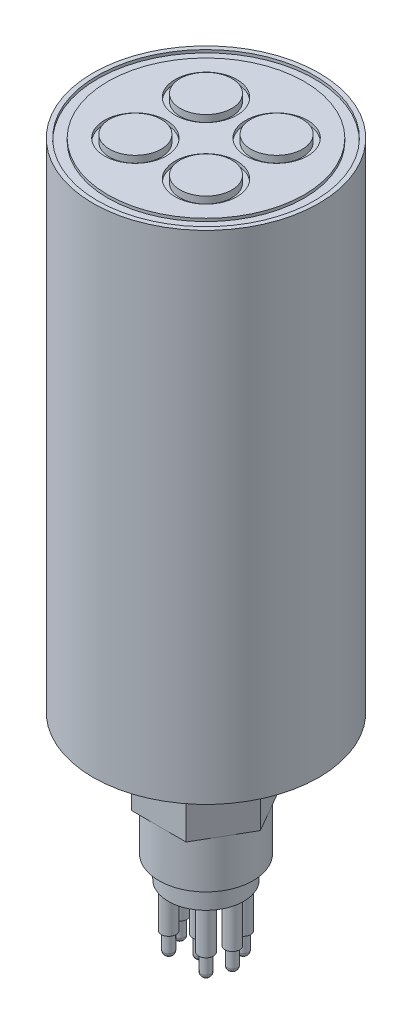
ISO-10303-21;
HEADER;
FILE_DESCRIPTION(('STEP AP214'),'2;1');
FILE_NAME('part.step','',(''),(''),'','','');
FILE_SCHEMA(('AUTOMOTIVE_DESIGN { 1 0 10303 214 1 1 1 1 }'));
ENDSEC;
DATA;
#1=APPLICATION_CONTEXT('core data for automotive mechanical design processes');
#2=APPLICATION_PROTOCOL_DEFINITION('international standard','automotive_design',2000,#1);
#3=PRODUCT_CONTEXT('',#1,'mechanical');
#4=PRODUCT('Part','Part','',(#3));
#5=PRODUCT_RELATED_PRODUCT_CATEGORY('part','',(#4));
#6=PRODUCT_DEFINITION_FORMATION('','',#4);
#7=PRODUCT_DEFINITION_CONTEXT('part definition',#1,'design');
#8=PRODUCT_DEFINITION('design','',#6,#7);
#9=PRODUCT_DEFINITION_SHAPE('','',#8);
#10=(LENGTH_UNIT() NAMED_UNIT(*) SI_UNIT(.MILLI.,.METRE.));
#11=(NAMED_UNIT(*) PLANE_ANGLE_UNIT() SI_UNIT($,.RADIAN.));
#12=(NAMED_UNIT(*) SI_UNIT($,.STERADIAN.) SOLID_ANGLE_UNIT());
#13=UNCERTAINTY_MEASURE_WITH_UNIT(LENGTH_MEASURE(1.E-05),#10,'distance_accuracy_value','');
#14=(GEOMETRIC_REPRESENTATION_CONTEXT(3) GLOBAL_UNCERTAINTY_ASSIGNED_CONTEXT((#13)) GLOBAL_UNIT_ASSIGNED_CONTEXT((#10,
#11,#12)) REPRESENTATION_CONTEXT('',''));
#15=CARTESIAN_POINT('',(0.,0.,0.));
#16=DIRECTION('',(0.,0.,1.));
#17=DIRECTION('',(1.,0.,0.));
#18=AXIS2_PLACEMENT_3D('',#15,#16,#17);
#19=CARTESIAN_POINT('',(0.,-29.337,0.));
#20=DIRECTION('',(0.,-1.,0.));
#21=DIRECTION('',(0.,0.,-1.));
#22=AXIS2_PLACEMENT_3D('',#19,#20,#21);
#23=PLANE('',#22);
#24=CARTESIAN_POINT('',(-3.771707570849,-29.337,3.77170757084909));
#25=DIRECTION('',(0.,-1.,0.));
#26=DIRECTION('',(1.,0.,0.));
#27=AXIS2_PLACEMENT_3D('',#24,#25,#26);
#28=CIRCLE('',#27,1.4859);
#29=CARTESIAN_POINT('',(-2.285807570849,-29.337,3.77170757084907));
#30=VERTEX_POINT('',#29);
#31=EDGE_CURVE('E168',#30,#30,#28,.T.);
#32=ORIENTED_EDGE('',*,*,#31,.F.);
#33=EDGE_LOOP('',(#32));
#34=FACE_BOUND('',#33,.T.);
#35=CARTESIAN_POINT('',(-3.77170757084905,-29.337,-3.77170757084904));
#36=DIRECTION('',(0.,-1.,0.));
#37=DIRECTION('',(0.,0.,1.));
#38=AXIS2_PLACEMENT_3D('',#35,#36,#37);
#39=CIRCLE('',#38,1.4859);
#40=CARTESIAN_POINT('',(-3.77170757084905,-29.337,-2.28580757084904));
#41=VERTEX_POINT('',#40);
#42=EDGE_CURVE('E178',#41,#41,#39,.T.);
#43=ORIENTED_EDGE('',*,*,#42,.F.);
#44=EDGE_LOOP('',(#43));
#45=FACE_BOUND('',#44,.T.);
#46=CARTESIAN_POINT('',(3.77170757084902,-29.337,-3.77170757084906));
#47=DIRECTION('',(0.,-1.,0.));
#48=DIRECTION('',(-1.,0.,0.));
#49=AXIS2_PLACEMENT_3D('',#46,#47,#48);
#50=CIRCLE('',#49,1.4859);
#51=CARTESIAN_POINT('',(2.28580757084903,-29.337,-3.77170757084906));
#52=VERTEX_POINT('',#51);
#53=EDGE_CURVE('E190',#52,#52,#50,.T.);
#54=ORIENTED_EDGE('',*,*,#53,.F.);
#55=EDGE_LOOP('',(#54));
#56=FACE_BOUND('',#55,.T.);
#57=CARTESIAN_POINT('',(3.77170757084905,-29.337,3.77170757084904));
#58=DIRECTION('',(0.,-1.,0.));
#59=DIRECTION('',(0.,0.,-1.));
#60=AXIS2_PLACEMENT_3D('',#57,#58,#59);
#61=CIRCLE('',#60,1.4859);
#62=CARTESIAN_POINT('',(3.77170757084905,-29.337,2.28580757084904));
#63=VERTEX_POINT('',#62);
#64=EDGE_CURVE('E207',#63,#63,#61,.T.);
#65=ORIENTED_EDGE('',*,*,#64,.F.);
#66=EDGE_LOOP('',(#65));
#67=FACE_BOUND('',#66,.T.);
#68=CARTESIAN_POINT('',(0.,-29.337,0.));
#69=DIRECTION('',(0.,-1.,0.));
#70=DIRECTION('',(0.,0.,-1.));
#71=AXIS2_PLACEMENT_3D('',#68,#69,#70);
#72=CIRCLE('',#71,7.62);
#73=CARTESIAN_POINT('',(0.,-29.337,-7.62));
#74=VERTEX_POINT('',#73);
#75=EDGE_CURVE('E214',#74,#74,#72,.T.);
#76=ORIENTED_EDGE('',*,*,#75,.T.);
#77=EDGE_LOOP('',(#76));
#78=FACE_BOUND('',#77,.T.);
#79=CARTESIAN_POINT('',(5.334,-29.337,0.));
#80=DIRECTION('',(0.,-1.,0.));
#81=DIRECTION('',(-0.707106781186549,0.,-0.707106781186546));
#82=AXIS2_PLACEMENT_3D('',#79,#80,#81);
#83=CIRCLE('',#82,1.4859);
#84=CARTESIAN_POINT('',(4.28331003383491,-29.337,-1.05068996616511));
#85=VERTEX_POINT('',#84);
#86=EDGE_CURVE('E196',#85,#85,#83,.T.);
#87=ORIENTED_EDGE('',*,*,#86,.F.);
#88=EDGE_LOOP('',(#87));
#89=FACE_BOUND('',#88,.T.);
#90=CARTESIAN_POINT('',(0.,-29.337,-5.334));
#91=DIRECTION('',(0.,-1.,0.));
#92=DIRECTION('',(-0.707106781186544,0.,0.707106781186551));
#93=AXIS2_PLACEMENT_3D('',#90,#91,#92);
#94=CIRCLE('',#93,1.4859);
#95=CARTESIAN_POINT('',(-1.05068996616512,-29.337,-4.2833100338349));
#96=VERTEX_POINT('',#95);
#97=EDGE_CURVE('E184',#96,#96,#94,.T.);
#98=ORIENTED_EDGE('',*,*,#97,.F.);
#99=EDGE_LOOP('',(#98));
#100=FACE_BOUND('',#99,.T.);
#101=CARTESIAN_POINT('',(-5.334,-29.337,0.));
#102=DIRECTION('',(0.,-1.,0.));
#103=DIRECTION('',(0.707106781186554,0.,0.707106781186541));
#104=AXIS2_PLACEMENT_3D('',#101,#102,#103);
#105=CIRCLE('',#104,1.4859);
#106=CARTESIAN_POINT('',(-4.2833100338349,-29.337,1.05068996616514));
#107=VERTEX_POINT('',#106);
#108=EDGE_CURVE('E172',#107,#107,#105,.T.);
#109=ORIENTED_EDGE('',*,*,#108,.F.);
#110=EDGE_LOOP('',(#109));
#111=FACE_BOUND('',#110,.T.);
#112=CARTESIAN_POINT('',(-0.000192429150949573,-29.337,1.23170757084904));
#113=DIRECTION('',(0.,-1.,0.));
#114=DIRECTION('',(0.,0.,-1.));
#115=AXIS2_PLACEMENT_3D('',#112,#113,#114);
#116=CIRCLE('',#115,1.4859);
#117=CARTESIAN_POINT('',(-0.000192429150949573,-29.337,-0.25419242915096));
#118=VERTEX_POINT('',#117);
#119=EDGE_CURVE('E128',#118,#118,#116,.T.);
#120=ORIENTED_EDGE('',*,*,#119,.F.);
#121=EDGE_LOOP('',(#120));
#122=FACE_BOUND('',#121,.T.);
#123=ADVANCED_FACE('F41',(#34,#45,#56,#67,#78,#89,#100,#111,#122),#23,.T.);
#124=CARTESIAN_POINT('',(-3.771707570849,-38.227,3.77170757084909));
#125=DIRECTION('',(0.,-1.,0.));
#126=DIRECTION('',(1.,0.,0.));
#127=AXIS2_PLACEMENT_3D('',#124,#125,#126);
#128=PLANE('',#127);
#129=CARTESIAN_POINT('',(-3.771707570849,-38.227,3.77170757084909));
#130=DIRECTION('',(0.,-1.,0.));
#131=DIRECTION('',(1.,0.,0.));
#132=AXIS2_PLACEMENT_3D('',#129,#130,#131);
#133=CIRCLE('',#132,1.4859);
#134=CARTESIAN_POINT('',(-2.285807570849,-38.227,3.77170757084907));
#135=VERTEX_POINT('',#134);
#136=EDGE_CURVE('E169',#135,#135,#133,.T.);
#137=ORIENTED_EDGE('',*,*,#136,.T.);
#138=EDGE_LOOP('',(#137));
#139=FACE_BOUND('',#138,.T.);
#140=CARTESIAN_POINT('',(-3.771707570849,-38.227,3.77170757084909));
#141=DIRECTION('',(0.,-1.,0.));
#142=DIRECTION('',(1.,0.,0.));
#143=AXIS2_PLACEMENT_3D('',#140,#141,#142);
#144=CIRCLE('',#143,1.016);
#145=CARTESIAN_POINT('',(-2.755707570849,-38.227,3.77170757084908));
#146=VERTEX_POINT('',#145);
#147=EDGE_CURVE('E150',#146,#146,#144,.T.);
#148=ORIENTED_EDGE('',*,*,#147,.F.);
#149=EDGE_LOOP('',(#148));
#150=FACE_BOUND('',#149,.T.);
#151=ADVANCED_FACE('F414',(#139,#150),#128,.T.);
#152=CARTESIAN_POINT('',(-5.334,-38.227,0.));
#153=DIRECTION('',(0.,-1.,0.));
#154=DIRECTION('',(0.707106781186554,0.,0.707106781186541));
#155=AXIS2_PLACEMENT_3D('',#152,#153,#154);
#156=PLANE('',#155);
#157=CARTESIAN_POINT('',(-5.334,-38.227,0.));
#158=DIRECTION('',(0.,-1.,0.));
#159=DIRECTION('',(0.707106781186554,0.,0.707106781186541));
#160=AXIS2_PLACEMENT_3D('',#157,#158,#159);
#161=CIRCLE('',#160,1.4859);
#162=CARTESIAN_POINT('',(-4.2833100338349,-38.227,1.05068996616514));
#163=VERTEX_POINT('',#162);
#164=EDGE_CURVE('E175',#163,#163,#161,.T.);
#165=ORIENTED_EDGE('',*,*,#164,.T.);
#166=EDGE_LOOP('',(#165));
#167=FACE_BOUND('',#166,.T.);
#168=CARTESIAN_POINT('',(-5.334,-38.227,0.));
#169=DIRECTION('',(0.,-1.,0.));
#170=DIRECTION('',(0.707106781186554,0.,0.707106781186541));
#171=AXIS2_PLACEMENT_3D('',#168,#169,#170);
#172=CIRCLE('',#171,1.016);
#173=CARTESIAN_POINT('',(-4.61557951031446,-38.227,0.718420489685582));
#174=VERTEX_POINT('',#173);
#175=EDGE_CURVE('E153',#174,#174,#172,.T.);
#176=ORIENTED_EDGE('',*,*,#175,.F.);
#177=EDGE_LOOP('',(#176));
#178=FACE_BOUND('',#177,.T.);
#179=ADVANCED_FACE('F420',(#167,#178),#156,.T.);
#180=CARTESIAN_POINT('',(-3.77170757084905,-38.227,-3.77170757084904));
#181=DIRECTION('',(0.,-1.,0.));
#182=DIRECTION('',(0.,0.,1.));
#183=AXIS2_PLACEMENT_3D('',#180,#181,#182);
#184=PLANE('',#183);
#185=CARTESIAN_POINT('',(-3.77170757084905,-38.227,-3.77170757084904));
#186=DIRECTION('',(0.,-1.,0.));
#187=DIRECTION('',(0.,0.,1.));
#188=AXIS2_PLACEMENT_3D('',#185,#186,#187);
#189=CIRCLE('',#188,1.4859);
#190=CARTESIAN_POINT('',(-3.77170757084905,-38.227,-2.28580757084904));
#191=VERTEX_POINT('',#190);
#192=EDGE_CURVE('E181',#191,#191,#189,.T.);
#193=ORIENTED_EDGE('',*,*,#192,.T.);
#194=EDGE_LOOP('',(#193));
#195=FACE_BOUND('',#194,.T.);
#196=CARTESIAN_POINT('',(-3.77170757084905,-38.227,-3.77170757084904));
#197=DIRECTION('',(0.,-1.,0.));
#198=DIRECTION('',(0.,0.,1.));
#199=AXIS2_PLACEMENT_3D('',#196,#197,#198);
#200=CIRCLE('',#199,1.016);
#201=CARTESIAN_POINT('',(-3.77170757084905,-38.227,-2.75570757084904));
#202=VERTEX_POINT('',#201);
#203=EDGE_CURVE('E156',#202,#202,#200,.T.);
#204=ORIENTED_EDGE('',*,*,#203,.F.);
#205=EDGE_LOOP('',(#204));
#206=FACE_BOUND('',#205,.T.);
#207=ADVANCED_FACE('F632',(#195,#206),#184,.T.);
#208=CARTESIAN_POINT('',(0.,-38.227,-5.334));
#209=DIRECTION('',(0.,-1.,0.));
#210=DIRECTION('',(-0.707106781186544,0.,0.707106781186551));
#211=AXIS2_PLACEMENT_3D('',#208,#209,#210);
#212=PLANE('',#211);
#213=CARTESIAN_POINT('',(0.,-38.227,-5.334));
#214=DIRECTION('',(0.,-1.,0.));
#215=DIRECTION('',(-0.707106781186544,0.,0.707106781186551));
#216=AXIS2_PLACEMENT_3D('',#213,#214,#215);
#217=CIRCLE('',#216,1.4859);
#218=CARTESIAN_POINT('',(-1.05068996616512,-38.227,-4.2833100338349));
#219=VERTEX_POINT('',#218);
#220=EDGE_CURVE('E187',#219,#219,#217,.T.);
#221=ORIENTED_EDGE('',*,*,#220,.T.);
#222=EDGE_LOOP('',(#221));
#223=FACE_BOUND('',#222,.T.);
#224=CARTESIAN_POINT('',(0.,-38.227,-5.334));
#225=DIRECTION('',(0.,-1.,0.));
#226=DIRECTION('',(-0.707106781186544,0.,0.707106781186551));
#227=AXIS2_PLACEMENT_3D('',#224,#225,#226);
#228=CIRCLE('',#227,1.016);
#229=CARTESIAN_POINT('',(-0.718420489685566,-38.227,-4.61557951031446));
#230=VERTEX_POINT('',#229);
#231=EDGE_CURVE('E159',#230,#230,#228,.T.);
#232=ORIENTED_EDGE('',*,*,#231,.F.);
#233=EDGE_LOOP('',(#232));
#234=FACE_BOUND('',#233,.T.);
#235=ADVANCED_FACE('F640',(#223,#234),#212,.T.);
#236=CARTESIAN_POINT('',(3.77170757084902,-38.227,-3.77170757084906));
#237=DIRECTION('',(0.,-1.,0.));
#238=DIRECTION('',(-1.,0.,0.));
#239=AXIS2_PLACEMENT_3D('',#236,#237,#238);
#240=PLANE('',#239);
#241=CARTESIAN_POINT('',(3.77170757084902,-38.227,-3.77170757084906));
#242=DIRECTION('',(0.,-1.,0.));
#243=DIRECTION('',(-1.,0.,0.));
#244=AXIS2_PLACEMENT_3D('',#241,#242,#243);
#245=CIRCLE('',#244,1.4859);
#246=CARTESIAN_POINT('',(2.28580757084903,-38.227,-3.77170757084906));
#247=VERTEX_POINT('',#246);
#248=EDGE_CURVE('E193',#247,#247,#245,.T.);
#249=ORIENTED_EDGE('',*,*,#248,.T.);
#250=EDGE_LOOP('',(#249));
#251=FACE_BOUND('',#250,.T.);
#252=CARTESIAN_POINT('',(3.77170757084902,-38.227,-3.77170757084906));
#253=DIRECTION('',(0.,-1.,0.));
#254=DIRECTION('',(-1.,0.,0.));
#255=AXIS2_PLACEMENT_3D('',#252,#253,#254);
#256=CIRCLE('',#255,1.016);
#257=CARTESIAN_POINT('',(2.75570757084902,-38.227,-3.77170757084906));
#258=VERTEX_POINT('',#257);
#259=EDGE_CURVE('E162',#258,#258,#256,.T.);
#260=ORIENTED_EDGE('',*,*,#259,.F.);
#261=EDGE_LOOP('',(#260));
#262=FACE_BOUND('',#261,.T.);
#263=ADVANCED_FACE('F648',(#251,#262),#240,.T.);
#264=CARTESIAN_POINT('',(5.334,-38.227,0.));
#265=DIRECTION('',(0.,-1.,0.));
#266=DIRECTION('',(-0.707106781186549,0.,-0.707106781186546));
#267=AXIS2_PLACEMENT_3D('',#264,#265,#266);
#268=PLANE('',#267);
#269=CARTESIAN_POINT('',(5.334,-38.227,0.));
#270=DIRECTION('',(0.,-1.,0.));
#271=DIRECTION('',(-0.707106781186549,0.,-0.707106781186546));
#272=AXIS2_PLACEMENT_3D('',#269,#270,#271);
#273=CIRCLE('',#272,1.4859);
#274=CARTESIAN_POINT('',(4.28331003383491,-38.227,-1.05068996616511));
#275=VERTEX_POINT('',#274);
#276=EDGE_CURVE('E199',#275,#275,#273,.T.);
#277=ORIENTED_EDGE('',*,*,#276,.T.);
#278=EDGE_LOOP('',(#277));
#279=FACE_BOUND('',#278,.T.);
#280=CARTESIAN_POINT('',(5.334,-38.227,0.));
#281=DIRECTION('',(0.,-1.,0.));
#282=DIRECTION('',(-0.707106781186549,0.,-0.707106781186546));
#283=AXIS2_PLACEMENT_3D('',#280,#281,#282);
#284=CIRCLE('',#283,1.016);
#285=CARTESIAN_POINT('',(4.61557951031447,-38.227,-0.718420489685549));
#286=VERTEX_POINT('',#285);
#287=EDGE_CURVE('E165',#286,#286,#284,.T.);
#288=ORIENTED_EDGE('',*,*,#287,.F.);
#289=EDGE_LOOP('',(#288));
#290=FACE_BOUND('',#289,.T.);
#291=ADVANCED_FACE('F656',(#279,#290),#268,.T.);
#292=CARTESIAN_POINT('',(3.77170757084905,-38.227,3.77170757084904));
#293=DIRECTION('',(0.,-1.,0.));
#294=DIRECTION('',(0.,0.,-1.));
#295=AXIS2_PLACEMENT_3D('',#292,#293,#294);
#296=PLANE('',#295);
#297=CARTESIAN_POINT('',(3.77170757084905,-38.227,3.77170757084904));
#298=DIRECTION('',(0.,-1.,0.));
#299=DIRECTION('',(0.,0.,-1.));
#300=AXIS2_PLACEMENT_3D('',#297,#298,#299);
#301=CIRCLE('',#300,1.4859);
#302=CARTESIAN_POINT('',(3.77170757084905,-38.227,2.28580757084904));
#303=VERTEX_POINT('',#302);
#304=EDGE_CURVE('E208',#303,#303,#301,.T.);
#305=ORIENTED_EDGE('',*,*,#304,.T.);
#306=EDGE_LOOP('',(#305));
#307=FACE_BOUND('',#306,.T.);
#308=CARTESIAN_POINT('',(3.77170757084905,-38.227,3.77170757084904));
#309=DIRECTION('',(0.,-1.,0.));
#310=DIRECTION('',(0.,0.,-1.));
#311=AXIS2_PLACEMENT_3D('',#308,#309,#310);
#312=CIRCLE('',#311,1.016);
#313=CARTESIAN_POINT('',(3.77170757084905,-38.227,2.75570757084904));
#314=VERTEX_POINT('',#313);
#315=EDGE_CURVE('E202',#314,#314,#312,.T.);
#316=ORIENTED_EDGE('',*,*,#315,.F.);
#317=EDGE_LOOP('',(#316));
#318=FACE_BOUND('',#317,.T.);
#319=ADVANCED_FACE('F438',(#307,#318),#296,.T.);
#320=CARTESIAN_POINT('',(0.,-24.765,0.));
#321=DIRECTION('',(0.,-1.,0.));
#322=DIRECTION('',(0.,0.,-1.));
#323=AXIS2_PLACEMENT_3D('',#320,#321,#322);
#324=PLANE('',#323);
#325=CARTESIAN_POINT('',(0.,-24.765,0.));
#326=DIRECTION('',(0.,-1.,0.));
#327=DIRECTION('',(0.,0.,-1.));
#328=AXIS2_PLACEMENT_3D('',#325,#326,#327);
#329=CIRCLE('',#328,9.525);
#330=CARTESIAN_POINT('',(0.,-24.765,-9.525));
#331=VERTEX_POINT('',#330);
#332=EDGE_CURVE('E220',#331,#331,#329,.T.);
#333=ORIENTED_EDGE('',*,*,#332,.T.);
#334=EDGE_LOOP('',(#333));
#335=FACE_BOUND('',#334,.T.);
#336=CARTESIAN_POINT('',(0.,-24.765,0.));
#337=DIRECTION('',(0.,-1.,0.));
#338=DIRECTION('',(0.,0.,-1.));
#339=AXIS2_PLACEMENT_3D('',#336,#337,#338);
#340=CIRCLE('',#339,7.62);
#341=CARTESIAN_POINT('',(0.,-24.765,-7.62));
#342=VERTEX_POINT('',#341);
#343=EDGE_CURVE('E211',#342,#342,#340,.T.);
#344=ORIENTED_EDGE('',*,*,#343,.F.);
#345=EDGE_LOOP('',(#344));
#346=FACE_BOUND('',#345,.T.);
#347=ADVANCED_FACE('F434',(#335,#346),#324,.T.);
#348=CARTESIAN_POINT('',(0.,-15.24,0.));
#349=DIRECTION('',(0.,-1.,0.));
#350=DIRECTION('',(0.,0.,-1.));
#351=AXIS2_PLACEMENT_3D('',#348,#349,#350);
#352=PLANE('',#351);
#353=CARTESIAN_POINT('',(0.,-15.24,0.));
#354=DIRECTION('',(0.,-1.,0.));
#355=DIRECTION('',(0.,0.,-1.));
#356=AXIS2_PLACEMENT_3D('',#353,#354,#355);
#357=CIRCLE('',#356,9.525);
#358=CARTESIAN_POINT('',(0.,-15.24,-9.525));
#359=VERTEX_POINT('',#358);
#360=CARTESIAN_POINT('',(8.24889197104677,-15.24,-4.7625));
#361=VERTEX_POINT('',#360);
#362=EDGE_CURVE('E217',#359,#361,#357,.T.);
#363=ORIENTED_EDGE('',*,*,#362,.F.);
#364=DIRECTION('',(1.,0.,0.));
#365=VECTOR('',#364,1.);
#366=CARTESIAN_POINT('',(-5.49926131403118,-15.24,-9.525));
#367=LINE('',#366,#365);
#368=CARTESIAN_POINT('',(5.49926131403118,-15.24,-9.525));
#369=VERTEX_POINT('',#368);
#370=EDGE_CURVE('E241',#359,#369,#367,.T.);
#371=ORIENTED_EDGE('',*,*,#370,.T.);
#372=DIRECTION('',(0.5,0.,0.866025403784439));
#373=VECTOR('',#372,1.);
#374=CARTESIAN_POINT('',(5.49926131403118,-15.24,-9.525));
#375=LINE('',#374,#373);
#376=EDGE_CURVE('E245',#369,#361,#375,.T.);
#377=ORIENTED_EDGE('',*,*,#376,.T.);
#378=EDGE_LOOP('',(#363,#371,#377));
#379=FACE_BOUND('',#378,.T.);
#380=ADVANCED_FACE('F437',(#379),#352,.T.);
#381=CARTESIAN_POINT('',(8.24889197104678,-15.24,4.7625));
#382=VERTEX_POINT('',#381);
#383=EDGE_CURVE('E60',#361,#382,#357,.T.);
#384=ORIENTED_EDGE('',*,*,#383,.F.);
#385=CARTESIAN_POINT('',(10.9985226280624,-15.24,0.));
#386=VERTEX_POINT('',#385);
#387=EDGE_CURVE('E244',#361,#386,#375,.T.);
#388=ORIENTED_EDGE('',*,*,#387,.T.);
#389=DIRECTION('',(-0.5,0.,0.866025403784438));
#390=VECTOR('',#389,1.);
#391=CARTESIAN_POINT('',(10.9985226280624,-15.24,0.));
#392=LINE('',#391,#390);
#393=EDGE_CURVE('E226',#386,#382,#392,.T.);
#394=ORIENTED_EDGE('',*,*,#393,.T.);
#395=EDGE_LOOP('',(#384,#388,#394));
#396=FACE_BOUND('',#395,.T.);
#397=ADVANCED_FACE('F744',(#396),#352,.T.);
#398=CARTESIAN_POINT('',(0.,-15.24,9.525));
#399=VERTEX_POINT('',#398);
#400=EDGE_CURVE('E748',#382,#399,#357,.T.);
#401=ORIENTED_EDGE('',*,*,#400,.F.);
#402=CARTESIAN_POINT('',(5.49926131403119,-15.24,9.525));
#403=VERTEX_POINT('',#402);
#404=EDGE_CURVE('E229',#382,#403,#392,.T.);
#405=ORIENTED_EDGE('',*,*,#404,.T.);
#406=DIRECTION('',(-1.,0.,0.));
#407=VECTOR('',#406,1.);
#408=CARTESIAN_POINT('',(5.49926131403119,-15.24,9.525));
#409=LINE('',#408,#407);
#410=EDGE_CURVE('E230',#403,#399,#409,.T.);
#411=ORIENTED_EDGE('',*,*,#410,.T.);
#412=EDGE_LOOP('',(#401,#405,#411));
#413=FACE_BOUND('',#412,.T.);
#414=ADVANCED_FACE('F771',(#413),#352,.T.);
#415=CARTESIAN_POINT('',(-8.24889197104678,-15.24,4.7625));
#416=VERTEX_POINT('',#415);
#417=EDGE_CURVE('E750',#399,#416,#357,.T.);
#418=ORIENTED_EDGE('',*,*,#417,.F.);
#419=CARTESIAN_POINT('',(-5.49926131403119,-15.24,9.525));
#420=VERTEX_POINT('',#419);
#421=EDGE_CURVE('E228',#399,#420,#409,.T.);
#422=ORIENTED_EDGE('',*,*,#421,.T.);
#423=DIRECTION('',(-0.5,0.,-0.866025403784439));
#424=VECTOR('',#423,1.);
#425=CARTESIAN_POINT('',(-5.49926131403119,-15.24,9.525));
#426=LINE('',#425,#424);
#427=EDGE_CURVE('E234',#420,#416,#426,.T.);
#428=ORIENTED_EDGE('',*,*,#427,.T.);
#429=EDGE_LOOP('',(#418,#422,#428));
#430=FACE_BOUND('',#429,.T.);
#431=ADVANCED_FACE('F759',(#430),#352,.T.);
#432=CARTESIAN_POINT('',(-8.24889197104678,-15.24,-4.7625));
#433=VERTEX_POINT('',#432);
#434=EDGE_CURVE('E751',#416,#433,#357,.T.);
#435=ORIENTED_EDGE('',*,*,#434,.F.);
#436=CARTESIAN_POINT('',(-10.9985226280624,-15.24,0.));
#437=VERTEX_POINT('',#436);
#438=EDGE_CURVE('E233',#416,#437,#426,.T.);
#439=ORIENTED_EDGE('',*,*,#438,.T.);
#440=DIRECTION('',(0.5,0.,-0.866025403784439));
#441=VECTOR('',#440,1.);
#442=CARTESIAN_POINT('',(-10.9985226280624,-15.24,0.));
#443=LINE('',#442,#441);
#444=EDGE_CURVE('E238',#437,#433,#443,.T.);
#445=ORIENTED_EDGE('',*,*,#444,.T.);
#446=EDGE_LOOP('',(#435,#439,#445));
#447=FACE_BOUND('',#446,.T.);
#448=ADVANCED_FACE('F447',(#447),#352,.T.);
#449=CARTESIAN_POINT('',(0.,0.,0.));
#450=DIRECTION('',(0.,1.,0.));
#451=DIRECTION('',(0.,0.,1.));
#452=AXIS2_PLACEMENT_3D('',#449,#450,#451);
#453=PLANE('',#452);
#454=CARTESIAN_POINT('',(0.,0.,0.));
#455=DIRECTION('',(0.,1.,0.));
#456=DIRECTION('',(0.,0.,1.));
#457=AXIS2_PLACEMENT_3D('',#454,#455,#456);
#458=CIRCLE('',#457,22.86);
#459=CARTESIAN_POINT('',(0.,0.,22.86));
#460=VERTEX_POINT('',#459);
#461=EDGE_CURVE('E335',#460,#460,#458,.T.);
#462=ORIENTED_EDGE('',*,*,#461,.F.);
#463=EDGE_LOOP('',(#462));
#464=FACE_BOUND('',#463,.T.);
#465=DIRECTION('',(-0.5,0.,0.866025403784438));
#466=VECTOR('',#465,1.);
#467=CARTESIAN_POINT('',(10.9985226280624,0.,0.));
#468=LINE('',#467,#466);
#469=CARTESIAN_POINT('',(10.9985226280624,0.,0.));
#470=VERTEX_POINT('',#469);
#471=CARTESIAN_POINT('',(5.49926131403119,0.,9.525));
#472=VERTEX_POINT('',#471);
#473=EDGE_CURVE('E223',#470,#472,#468,.T.);
#474=ORIENTED_EDGE('',*,*,#473,.F.);
#475=DIRECTION('',(0.5,0.,0.866025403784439));
#476=VECTOR('',#475,1.);
#477=CARTESIAN_POINT('',(5.49926131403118,0.,-9.525));
#478=LINE('',#477,#476);
#479=CARTESIAN_POINT('',(5.49926131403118,0.,-9.525));
#480=VERTEX_POINT('',#479);
#481=EDGE_CURVE('E263',#480,#470,#478,.T.);
#482=ORIENTED_EDGE('',*,*,#481,.F.);
#483=DIRECTION('',(1.,0.,0.));
#484=VECTOR('',#483,1.);
#485=CARTESIAN_POINT('',(-5.49926131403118,0.,-9.525));
#486=LINE('',#485,#484);
#487=CARTESIAN_POINT('',(-5.49926131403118,0.,-9.525));
#488=VERTEX_POINT('',#487);
#489=EDGE_CURVE('E260',#488,#480,#486,.T.);
#490=ORIENTED_EDGE('',*,*,#489,.F.);
#491=DIRECTION('',(0.5,0.,-0.866025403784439));
#492=VECTOR('',#491,1.);
#493=CARTESIAN_POINT('',(-10.9985226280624,0.,0.));
#494=LINE('',#493,#492);
#495=CARTESIAN_POINT('',(-10.9985226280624,0.,0.));
#496=VERTEX_POINT('',#495);
#497=EDGE_CURVE('E257',#496,#488,#494,.T.);
#498=ORIENTED_EDGE('',*,*,#497,.F.);
#499=DIRECTION('',(-0.5,0.,-0.866025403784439));
#500=VECTOR('',#499,1.);
#501=CARTESIAN_POINT('',(-5.49926131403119,0.,9.525));
#502=LINE('',#501,#500);
#503=CARTESIAN_POINT('',(-5.49926131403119,0.,9.525));
#504=VERTEX_POINT('',#503);
#505=EDGE_CURVE('E254',#504,#496,#502,.T.);
#506=ORIENTED_EDGE('',*,*,#505,.F.);
#507=DIRECTION('',(-1.,0.,0.));
#508=VECTOR('',#507,1.);
#509=CARTESIAN_POINT('',(5.49926131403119,0.,9.525));
#510=LINE('',#509,#508);
#511=EDGE_CURVE('E251',#472,#504,#510,.T.);
#512=ORIENTED_EDGE('',*,*,#511,.F.);
#513=EDGE_LOOP('',(#474,#482,#490,#498,#506,#512));
#514=FACE_BOUND('',#513,.T.);
#515=ADVANCED_FACE('F508',(#464,#514),#453,.F.);
#516=CARTESIAN_POINT('',(-7.14375,99.8728,7.14375));
#517=DIRECTION('',(0.,-1.,0.));
#518=DIRECTION('',(0.,0.,-1.));
#519=AXIS2_PLACEMENT_3D('',#516,#517,#518);
#520=PLANE('',#519);
#521=CARTESIAN_POINT('',(-7.14375,99.8728,7.14375));
#522=DIRECTION('',(0.,1.,0.));
#523=DIRECTION('',(0.,0.,-1.));
#524=AXIS2_PLACEMENT_3D('',#521,#522,#523);
#525=CIRCLE('',#524,6.25475);
#526=CARTESIAN_POINT('',(-7.14375,99.8728,0.888999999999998));
#527=VERTEX_POINT('',#526);
#528=EDGE_CURVE('E302',#527,#527,#525,.T.);
#529=ORIENTED_EDGE('',*,*,#528,.T.);
#530=EDGE_LOOP('',(#529));
#531=FACE_BOUND('',#530,.T.);
#532=CARTESIAN_POINT('',(-7.14375,99.8728,7.14375));
#533=DIRECTION('',(0.,-1.,0.));
#534=DIRECTION('',(0.,0.,-1.));
#535=AXIS2_PLACEMENT_3D('',#532,#533,#534);
#536=CIRCLE('',#535,5.2324);
#537=CARTESIAN_POINT('',(-7.14375,99.8728,1.91135));
#538=VERTEX_POINT('',#537);
#539=EDGE_CURVE('E346',#538,#538,#536,.F.);
#540=ORIENTED_EDGE('',*,*,#539,.F.);
#541=EDGE_LOOP('',(#540));
#542=FACE_BOUND('',#541,.T.);
#543=ADVANCED_FACE('F504',(#531,#542),#520,.F.);
#544=CARTESIAN_POINT('',(7.14375,99.8728,7.14375));
#545=DIRECTION('',(0.,1.,0.));
#546=DIRECTION('',(0.,0.,1.));
#547=AXIS2_PLACEMENT_3D('',#544,#545,#546);
#548=PLANE('',#547);
#549=CARTESIAN_POINT('',(7.14375,99.8728,7.14375));
#550=DIRECTION('',(0.,1.,0.));
#551=DIRECTION('',(0.,0.,1.));
#552=AXIS2_PLACEMENT_3D('',#549,#550,#551);
#553=CIRCLE('',#552,6.25475);
#554=CARTESIAN_POINT('',(7.14375,99.8728,13.3985));
#555=VERTEX_POINT('',#554);
#556=EDGE_CURVE('E308',#555,#555,#553,.T.);
#557=ORIENTED_EDGE('',*,*,#556,.T.);
#558=EDGE_LOOP('',(#557));
#559=FACE_BOUND('',#558,.T.);
#560=CARTESIAN_POINT('',(7.14375,99.8728,7.14375));
#561=DIRECTION('',(0.,1.,0.));
#562=DIRECTION('',(0.,0.,1.));
#563=AXIS2_PLACEMENT_3D('',#560,#561,#562);
#564=CIRCLE('',#563,5.2324);
#565=CARTESIAN_POINT('',(7.14375,99.8728,12.37615));
#566=VERTEX_POINT('',#565);
#567=EDGE_CURVE('E286',#566,#566,#564,.T.);
#568=ORIENTED_EDGE('',*,*,#567,.F.);
#569=EDGE_LOOP('',(#568));
#570=FACE_BOUND('',#569,.T.);
#571=ADVANCED_FACE('F507',(#559,#570),#548,.T.);
#572=CARTESIAN_POINT('',(7.14375,99.8728,-7.14375));
#573=DIRECTION('',(0.,-1.,0.));
#574=DIRECTION('',(0.,0.,-1.));
#575=AXIS2_PLACEMENT_3D('',#572,#573,#574);
#576=PLANE('',#575);
#577=CARTESIAN_POINT('',(7.14375,99.8728,-7.14375));
#578=DIRECTION('',(0.,1.,0.));
#579=DIRECTION('',(0.,0.,-1.));
#580=AXIS2_PLACEMENT_3D('',#577,#578,#579);
#581=CIRCLE('',#580,6.25475);
#582=CARTESIAN_POINT('',(7.14375,99.8728,-13.3985));
#583=VERTEX_POINT('',#582);
#584=EDGE_CURVE('E314',#583,#583,#581,.T.);
#585=ORIENTED_EDGE('',*,*,#584,.T.);
#586=EDGE_LOOP('',(#585));
#587=FACE_BOUND('',#586,.T.);
#588=CARTESIAN_POINT('',(7.14375,99.8728,-7.14375));
#589=DIRECTION('',(0.,-1.,0.));
#590=DIRECTION('',(0.,0.,-1.));
#591=AXIS2_PLACEMENT_3D('',#588,#589,#590);
#592=CIRCLE('',#591,5.2324);
#593=CARTESIAN_POINT('',(7.14375,99.8728,-12.37615));
#594=VERTEX_POINT('',#593);
#595=EDGE_CURVE('E341',#594,#594,#592,.F.);
#596=ORIENTED_EDGE('',*,*,#595,.F.);
#597=EDGE_LOOP('',(#596));
#598=FACE_BOUND('',#597,.T.);
#599=ADVANCED_FACE('F516',(#587,#598),#576,.F.);
#600=CARTESIAN_POINT('',(-7.14375,99.8728,-7.14375));
#601=DIRECTION('',(0.,1.,0.));
#602=DIRECTION('',(0.,0.,1.));
#603=AXIS2_PLACEMENT_3D('',#600,#601,#602);
#604=PLANE('',#603);
#605=CARTESIAN_POINT('',(-7.14375,99.8728,-7.14375));
#606=DIRECTION('',(0.,1.,0.));
#607=DIRECTION('',(0.,0.,1.));
#608=AXIS2_PLACEMENT_3D('',#605,#606,#607);
#609=CIRCLE('',#608,6.25475);
#610=CARTESIAN_POINT('',(-7.14375,99.8728,-0.888999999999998));
#611=VERTEX_POINT('',#610);
#612=EDGE_CURVE('E320',#611,#611,#609,.T.);
#613=ORIENTED_EDGE('',*,*,#612,.T.);
#614=EDGE_LOOP('',(#613));
#615=FACE_BOUND('',#614,.T.);
#616=CARTESIAN_POINT('',(-7.14375,99.8728,-7.14375));
#617=DIRECTION('',(0.,1.,0.));
#618=DIRECTION('',(0.,0.,1.));
#619=AXIS2_PLACEMENT_3D('',#616,#617,#618);
#620=CIRCLE('',#619,5.2324);
#621=CARTESIAN_POINT('',(-7.14375,99.8728,-1.91135));
#622=VERTEX_POINT('',#621);
#623=EDGE_CURVE('E295',#622,#622,#620,.T.);
#624=ORIENTED_EDGE('',*,*,#623,.F.);
#625=EDGE_LOOP('',(#624));
#626=FACE_BOUND('',#625,.T.);
#627=ADVANCED_FACE('F524',(#615,#626),#604,.T.);
#628=CARTESIAN_POINT('',(0.,100.584,0.));
#629=DIRECTION('',(0.,-1.,0.));
#630=DIRECTION('',(0.,0.,-1.));
#631=AXIS2_PLACEMENT_3D('',#628,#629,#630);
#632=CYLINDRICAL_SURFACE('',#631,22.86);
#633=CARTESIAN_POINT('',(0.,78.509287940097,-22.86));
#634=CARTESIAN_POINT('',(-0.0982894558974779,78.5092836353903,-22.8599991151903));
#635=CARTESIAN_POINT('',(-0.19664649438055,78.5009917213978,-22.8593593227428));
#636=CARTESIAN_POINT('',(-0.390641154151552,78.4680346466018,-22.8568685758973));
#637=CARTESIAN_POINT('',(-0.486275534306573,78.4433507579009,-22.8550162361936));
#638=CARTESIAN_POINT('',(-0.671987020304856,78.3783260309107,-22.8503097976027));
#639=CARTESIAN_POINT('',(-0.762067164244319,78.3379938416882,-22.8474562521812));
#640=CARTESIAN_POINT('',(-0.934156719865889,78.2428323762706,-22.8410677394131));
#641=CARTESIAN_POINT('',(-1.01616789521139,78.1880062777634,-22.8375329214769));
#642=CARTESIAN_POINT('',(-1.16999258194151,78.0652837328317,-22.8301701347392));
#643=CARTESIAN_POINT('',(-1.24178610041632,77.9973622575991,-22.8263416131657));
#644=CARTESIAN_POINT('',(-1.37296613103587,77.8504295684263,-22.818827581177));
#645=CARTESIAN_POINT('',(-1.43235210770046,77.7714178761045,-22.8151420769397));
#646=CARTESIAN_POINT('',(-1.53709738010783,77.6044286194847,-22.8083252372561));
#647=CARTESIAN_POINT('',(-1.58243936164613,77.5164401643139,-22.8051945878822));
#648=CARTESIAN_POINT('',(-1.65769890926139,77.3340710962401,-22.7998479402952));
#649=CARTESIAN_POINT('',(-1.68761671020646,77.2396905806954,-22.7976319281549));
#650=CARTESIAN_POINT('',(-1.73112130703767,77.0474148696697,-22.7943698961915));
#651=CARTESIAN_POINT('',(-1.7447403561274,76.9495270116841,-22.7933215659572));
#652=CARTESIAN_POINT('',(-1.75536046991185,76.7528495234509,-22.7925062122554));
#653=CARTESIAN_POINT('',(-1.75236180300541,76.6540599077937,-22.7927391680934));
#654=CARTESIAN_POINT('',(-1.72985829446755,76.458603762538,-22.7944579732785));
#655=CARTESIAN_POINT('',(-1.71038845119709,76.361933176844,-22.7959411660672));
#656=CARTESIAN_POINT('',(-1.65554961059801,76.1732361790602,-22.7999891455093));
#657=CARTESIAN_POINT('',(-1.62018047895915,76.08120980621,-22.8025539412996));
#658=CARTESIAN_POINT('',(-1.53450768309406,75.9043016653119,-22.8084791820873));
#659=CARTESIAN_POINT('',(-1.48418825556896,75.8194275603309,-22.8118404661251));
#660=CARTESIAN_POINT('',(-1.37005463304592,75.6593170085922,-22.8189791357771));
#661=CARTESIAN_POINT('',(-1.30624020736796,75.5840807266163,-22.8227565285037));
#662=CARTESIAN_POINT('',(-1.16673146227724,75.4451779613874,-22.8303135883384));
#663=CARTESIAN_POINT('',(-1.09100687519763,75.3815418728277,-22.8340932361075));
#664=CARTESIAN_POINT('',(-0.929933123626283,75.2678806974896,-22.8412195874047));
#665=CARTESIAN_POINT('',(-0.844583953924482,75.2178556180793,-22.8445662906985));
#666=CARTESIAN_POINT('',(-0.666664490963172,75.1328386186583,-22.8504501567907));
#667=CARTESIAN_POINT('',(-0.574093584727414,75.0978479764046,-22.8529872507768));
#668=CARTESIAN_POINT('',(-0.384367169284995,75.0439140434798,-22.8569651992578));
#669=CARTESIAN_POINT('',(-0.287211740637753,75.0249704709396,-22.858406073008));
#670=CARTESIAN_POINT('',(-0.0913377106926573,75.0037063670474,-22.8600267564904));
#671=CARTESIAN_POINT('',(0.00737630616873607,75.001343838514,-22.8602097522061));
#672=CARTESIAN_POINT('',(0.203797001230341,75.0131989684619,-22.8593025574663));
#673=CARTESIAN_POINT('',(0.30150368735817,75.0274164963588,-22.8582123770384));
#674=CARTESIAN_POINT('',(0.493016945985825,75.0719933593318,-22.854883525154));
#675=CARTESIAN_POINT('',(0.586828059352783,75.1023332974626,-22.8526462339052));
#676=CARTESIAN_POINT('',(0.768027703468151,75.1782739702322,-22.8472746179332));
#677=CARTESIAN_POINT('',(0.855416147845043,75.2238749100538,-22.8441402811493));
#678=CARTESIAN_POINT('',(1.02148136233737,75.3291491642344,-22.8373182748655));
#679=CARTESIAN_POINT('',(1.10014039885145,75.3888503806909,-22.8336295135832));
#680=CARTESIAN_POINT('',(1.24633511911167,75.5205900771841,-22.8261170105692));
#681=CARTESIAN_POINT('',(1.31387063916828,75.5926287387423,-22.8222932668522));
#682=CARTESIAN_POINT('',(1.4360446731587,75.7471802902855,-22.8149323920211));
#683=CARTESIAN_POINT('',(1.49065583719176,75.829714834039,-22.8113958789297));
#684=CARTESIAN_POINT('',(1.58524358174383,76.0028071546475,-22.8050183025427));
#685=CARTESIAN_POINT('',(1.62522028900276,76.0933648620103,-22.8021772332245));
#686=CARTESIAN_POINT('',(1.68935746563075,76.2798349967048,-22.7975154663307));
#687=CARTESIAN_POINT('',(1.71353484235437,76.375741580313,-22.7956936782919));
#688=CARTESIAN_POINT('',(1.74544215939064,76.5702674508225,-22.793272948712));
#689=CARTESIAN_POINT('',(1.75317236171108,76.6688866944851,-22.7926739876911));
#690=CARTESIAN_POINT('',(1.75196306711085,76.8657666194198,-22.792766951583));
#691=CARTESIAN_POINT('',(1.74306654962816,76.9640275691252,-22.7934555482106));
#692=CARTESIAN_POINT('',(1.70894579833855,77.1576556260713,-22.7960389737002));
#693=CARTESIAN_POINT('',(1.68372153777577,77.2530227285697,-22.7979338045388));
#694=CARTESIAN_POINT('',(1.61767182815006,77.4381599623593,-22.802715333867));
#695=CARTESIAN_POINT('',(1.57684696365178,77.527930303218,-22.8056019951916));
#696=CARTESIAN_POINT('',(1.48075999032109,77.69934952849,-22.8120419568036));
#697=CARTESIAN_POINT('',(1.4254981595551,77.7809985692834,-22.8155952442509));
#698=CARTESIAN_POINT('',(1.30194486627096,77.934077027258,-22.8229789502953));
#699=CARTESIAN_POINT('',(1.23362174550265,78.0054808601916,-22.8268100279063));
#700=CARTESIAN_POINT('',(1.08593933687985,78.135834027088,-22.8343116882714));
#701=CARTESIAN_POINT('',(1.00657737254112,78.1947803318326,-22.8379822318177));
#702=CARTESIAN_POINT('',(0.838939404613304,78.2986114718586,-22.844754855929));
#703=CARTESIAN_POINT('',(0.750649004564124,78.3434731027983,-22.8478559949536));
#704=CARTESIAN_POINT('',(0.567826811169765,78.4176787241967,-22.8531289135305));
#705=CARTESIAN_POINT('',(0.473302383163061,78.4470406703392,-22.8553017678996));
#706=CARTESIAN_POINT('',(0.315177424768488,78.4818814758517,-22.8579114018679));
#707=CARTESIAN_POINT('',(0.252595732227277,78.4921453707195,-22.8586910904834));
#708=CARTESIAN_POINT('',(0.126685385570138,78.5058499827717,-22.8597356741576));
#709=CARTESIAN_POINT('',(0.0633567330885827,78.5092907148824,-22.8600005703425));
#710=CARTESIAN_POINT('',(0.,78.509287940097,-22.86));
#711=B_SPLINE_CURVE_WITH_KNOTS('',3,(#633,#634,#635,#636,#637,#638,#639,#640,#641,#642,#643,
#644,#645,#646,#647,#648,#649,#650,#651,#652,#653,#654,#655,#656,#657,#658,#659,#660,#661,#662,
#663,#664,#665,#666,#667,#668,#669,#670,#671,#672,#673,#674,#675,#676,#677,#678,#679,#680,#681,
#682,#683,#684,#685,#686,#687,#688,#689,#690,#691,#692,#693,#694,#695,#696,#697,#698,#699,#700,
#701,#702,#703,#704,#705,#706,#707,#708,#709,#710),.UNSPECIFIED.,.T.,.F.,(4,2,2,2,2,2,2,2,2,2,2,
2,2,2,2,2,2,2,2,2,2,2,2,2,2,2,2,2,2,2,2,2,2,2,2,2,2,2,4),(0.,0.294637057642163,
0.589611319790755,0.88442277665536,1.17916965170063,1.47448555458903,1.76981419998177,
2.0655055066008,2.36119231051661,2.65629301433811,2.95138895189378,3.24585943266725,
3.54033240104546,3.83511696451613,4.12990656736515,4.42545780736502,4.72100920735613,
5.01658572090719,5.31215704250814,5.60697945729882,5.90179955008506,6.1962657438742,
6.49073589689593,6.78579371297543,7.08085587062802,7.37653695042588,7.67221546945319,
7.96757705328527,8.26293393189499,8.55752838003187,8.85212331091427,9.14670720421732,
9.44128542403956,9.73658691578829,10.0319601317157,10.3278174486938,10.6233312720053,
10.81325278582,11.0031738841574),.UNSPECIFIED.);
#712=CARTESIAN_POINT('',(0.,78.509287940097,-22.86));
#713=VERTEX_POINT('',#712);
#714=EDGE_CURVE('E11',#713,#713,#711,.T.);
#715=ORIENTED_EDGE('',*,*,#714,.T.);
#716=EDGE_LOOP('',(#715));
#717=FACE_BOUND('',#716,.T.);
#718=CARTESIAN_POINT('',(0.,100.584,0.));
#719=DIRECTION('',(0.,1.,0.));
#720=DIRECTION('',(0.,0.,1.));
#721=AXIS2_PLACEMENT_3D('',#718,#719,#720);
#722=CIRCLE('',#721,22.86);
#723=CARTESIAN_POINT('',(0.,100.584,22.86));
#724=VERTEX_POINT('',#723);
#725=EDGE_CURVE('E338',#724,#724,#722,.T.);
#726=ORIENTED_EDGE('',*,*,#725,.F.);
#727=EDGE_LOOP('',(#726));
#728=FACE_BOUND('',#727,.T.);
#729=ORIENTED_EDGE('',*,*,#461,.T.);
#730=EDGE_LOOP('',(#729));
#731=FACE_BOUND('',#730,.T.);
#732=ADVANCED_FACE('F532',(#717,#728,#731),#632,.T.);
#733=CARTESIAN_POINT('',(0.,100.584,0.));
#734=DIRECTION('',(0.,1.,0.));
#735=DIRECTION('',(0.,0.,1.));
#736=AXIS2_PLACEMENT_3D('',#733,#734,#735);
#737=PLANE('',#736);
#738=CARTESIAN_POINT('',(0.,100.584,0.));
#739=DIRECTION('',(0.,1.,0.));
#740=DIRECTION('',(0.,0.,1.));
#741=AXIS2_PLACEMENT_3D('',#738,#739,#740);
#742=CIRCLE('',#741,21.9456);
#743=CARTESIAN_POINT('',(0.,100.584,21.9456));
#744=VERTEX_POINT('',#743);
#745=EDGE_CURVE('E329',#744,#744,#742,.T.);
#746=ORIENTED_EDGE('',*,*,#745,.F.);
#747=EDGE_LOOP('',(#746));
#748=FACE_BOUND('',#747,.T.);
#749=ORIENTED_EDGE('',*,*,#725,.T.);
#750=EDGE_LOOP('',(#749));
#751=FACE_BOUND('',#750,.T.);
#752=ADVANCED_FACE('F549',(#748,#751),#737,.T.);
#753=CARTESIAN_POINT('',(0.,99.9998,0.));
#754=DIRECTION('',(0.,1.,0.));
#755=DIRECTION('',(0.,0.,1.));
#756=AXIS2_PLACEMENT_3D('',#753,#754,#755);
#757=CYLINDRICAL_SURFACE('',#756,21.9456);
#758=CARTESIAN_POINT('',(0.,99.9998,0.));
#759=DIRECTION('',(0.,1.,0.));
#760=DIRECTION('',(0.,0.,1.));
#761=AXIS2_PLACEMENT_3D('',#758,#759,#760);
#762=CIRCLE('',#761,21.9456);
#763=CARTESIAN_POINT('',(0.,99.9998,21.9456));
#764=VERTEX_POINT('',#763);
#765=EDGE_CURVE('E332',#764,#764,#762,.T.);
#766=ORIENTED_EDGE('',*,*,#765,.F.);
#767=EDGE_LOOP('',(#766));
#768=FACE_BOUND('',#767,.T.);
#769=ORIENTED_EDGE('',*,*,#745,.T.);
#770=EDGE_LOOP('',(#769));
#771=FACE_BOUND('',#770,.T.);
#772=ADVANCED_FACE('F545',(#768,#771),#757,.F.);
#773=CARTESIAN_POINT('',(0.,99.9998,0.));
#774=DIRECTION('',(0.,1.,0.));
#775=DIRECTION('',(0.,0.,1.));
#776=AXIS2_PLACEMENT_3D('',#773,#774,#775);
#777=PLANE('',#776);
#778=CARTESIAN_POINT('',(0.,99.9998,0.));
#779=DIRECTION('',(0.,1.,0.));
#780=DIRECTION('',(0.,0.,1.));
#781=AXIS2_PLACEMENT_3D('',#778,#779,#780);
#782=CIRCLE('',#781,19.8628);
#783=CARTESIAN_POINT('',(0.,99.9998,19.8628));
#784=VERTEX_POINT('',#783);
#785=EDGE_CURVE('E326',#784,#784,#782,.T.);
#786=ORIENTED_EDGE('',*,*,#785,.F.);
#787=EDGE_LOOP('',(#786));
#788=FACE_BOUND('',#787,.T.);
#789=ORIENTED_EDGE('',*,*,#765,.T.);
#790=EDGE_LOOP('',(#789));
#791=FACE_BOUND('',#790,.T.);
#792=ADVANCED_FACE('F541',(#788,#791),#777,.T.);
#793=CARTESIAN_POINT('',(0.,99.9998,0.));
#794=DIRECTION('',(0.,1.,0.));
#795=DIRECTION('',(0.,0.,1.));
#796=AXIS2_PLACEMENT_3D('',#793,#794,#795);
#797=CYLINDRICAL_SURFACE('',#796,19.8628);
#798=ORIENTED_EDGE('',*,*,#785,.T.);
#799=EDGE_LOOP('',(#798));
#800=FACE_BOUND('',#799,.T.);
#801=CARTESIAN_POINT('',(0.,100.584,0.));
#802=DIRECTION('',(0.,1.,0.));
#803=DIRECTION('',(0.,0.,1.));
#804=AXIS2_PLACEMENT_3D('',#801,#802,#803);
#805=CIRCLE('',#804,19.8628);
#806=CARTESIAN_POINT('',(0.,100.584,19.8628));
#807=VERTEX_POINT('',#806);
#808=EDGE_CURVE('E323',#807,#807,#805,.T.);
#809=ORIENTED_EDGE('',*,*,#808,.F.);
#810=EDGE_LOOP('',(#809));
#811=FACE_BOUND('',#810,.T.);
#812=ADVANCED_FACE('F538',(#800,#811),#797,.T.);
#813=CARTESIAN_POINT('',(-7.14375,100.584,7.14375));
#814=DIRECTION('',(0.,1.,0.));
#815=DIRECTION('',(0.,0.,-1.));
#816=AXIS2_PLACEMENT_3D('',#813,#814,#815);
#817=CIRCLE('',#816,6.25475);
#818=CARTESIAN_POINT('',(-7.14375,100.584,0.888999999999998));
#819=VERTEX_POINT('',#818);
#820=EDGE_CURVE('E299',#819,#819,#817,.T.);
#821=ORIENTED_EDGE('',*,*,#820,.F.);
#822=EDGE_LOOP('',(#821));
#823=FACE_BOUND('',#822,.T.);
#824=CARTESIAN_POINT('',(7.14375,100.584,7.14375));
#825=DIRECTION('',(0.,1.,0.));
#826=DIRECTION('',(0.,0.,1.));
#827=AXIS2_PLACEMENT_3D('',#824,#825,#826);
#828=CIRCLE('',#827,6.25475);
#829=CARTESIAN_POINT('',(7.14375,100.584,13.3985));
#830=VERTEX_POINT('',#829);
#831=EDGE_CURVE('E305',#830,#830,#828,.T.);
#832=ORIENTED_EDGE('',*,*,#831,.F.);
#833=EDGE_LOOP('',(#832));
#834=FACE_BOUND('',#833,.T.);
#835=CARTESIAN_POINT('',(7.14375,100.584,-7.14375));
#836=DIRECTION('',(0.,1.,0.));
#837=DIRECTION('',(0.,0.,-1.));
#838=AXIS2_PLACEMENT_3D('',#835,#836,#837);
#839=CIRCLE('',#838,6.25475);
#840=CARTESIAN_POINT('',(7.14375,100.584,-13.3985));
#841=VERTEX_POINT('',#840);
#842=EDGE_CURVE('E311',#841,#841,#839,.T.);
#843=ORIENTED_EDGE('',*,*,#842,.F.);
#844=EDGE_LOOP('',(#843));
#845=FACE_BOUND('',#844,.T.);
#846=CARTESIAN_POINT('',(-7.14375,100.584,-7.14375));
#847=DIRECTION('',(0.,1.,0.));
#848=DIRECTION('',(0.,0.,1.));
#849=AXIS2_PLACEMENT_3D('',#846,#847,#848);
#850=CIRCLE('',#849,6.25475);
#851=CARTESIAN_POINT('',(-7.14375,100.584,-0.888999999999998));
#852=VERTEX_POINT('',#851);
#853=EDGE_CURVE('E317',#852,#852,#850,.T.);
#854=ORIENTED_EDGE('',*,*,#853,.F.);
#855=EDGE_LOOP('',(#854));
#856=FACE_BOUND('',#855,.T.);
#857=ORIENTED_EDGE('',*,*,#808,.T.);
#858=EDGE_LOOP('',(#857));
#859=FACE_BOUND('',#858,.T.);
#860=ADVANCED_FACE('F536',(#823,#834,#845,#856,#859),#737,.T.);
#861=CARTESIAN_POINT('',(-7.14375,99.8728,-7.14375));
#862=DIRECTION('',(0.,1.,0.));
#863=DIRECTION('',(0.,0.,1.));
#864=AXIS2_PLACEMENT_3D('',#861,#862,#863);
#865=CYLINDRICAL_SURFACE('',#864,6.25475);
#866=ORIENTED_EDGE('',*,*,#612,.F.);
#867=EDGE_LOOP('',(#866));
#868=FACE_BOUND('',#867,.T.);
#869=ORIENTED_EDGE('',*,*,#853,.T.);
#870=EDGE_LOOP('',(#869));
#871=FACE_BOUND('',#870,.T.);
#872=ADVANCED_FACE('F528',(#868,#871),#865,.F.);
#873=CARTESIAN_POINT('',(7.14375,99.8728,-7.14375));
#874=DIRECTION('',(0.,1.,0.));
#875=DIRECTION('',(0.,0.,1.));
#876=AXIS2_PLACEMENT_3D('',#873,#874,#875);
#877=CYLINDRICAL_SURFACE('',#876,6.25475);
#878=ORIENTED_EDGE('',*,*,#584,.F.);
#879=EDGE_LOOP('',(#878));
#880=FACE_BOUND('',#879,.T.);
#881=ORIENTED_EDGE('',*,*,#842,.T.);
#882=EDGE_LOOP('',(#881));
#883=FACE_BOUND('',#882,.T.);
#884=ADVANCED_FACE('F520',(#880,#883),#877,.F.);
#885=CARTESIAN_POINT('',(7.14375,99.8728,7.14375));
#886=DIRECTION('',(0.,1.,0.));
#887=DIRECTION('',(0.,0.,1.));
#888=AXIS2_PLACEMENT_3D('',#885,#886,#887);
#889=CYLINDRICAL_SURFACE('',#888,6.25475);
#890=ORIENTED_EDGE('',*,*,#556,.F.);
#891=EDGE_LOOP('',(#890));
#892=FACE_BOUND('',#891,.T.);
#893=ORIENTED_EDGE('',*,*,#831,.T.);
#894=EDGE_LOOP('',(#893));
#895=FACE_BOUND('',#894,.T.);
#896=ADVANCED_FACE('F512',(#892,#895),#889,.F.);
#897=CARTESIAN_POINT('',(-7.14375,99.8728,7.14375));
#898=DIRECTION('',(0.,1.,0.));
#899=DIRECTION('',(0.,0.,1.));
#900=AXIS2_PLACEMENT_3D('',#897,#898,#899);
#901=CYLINDRICAL_SURFACE('',#900,6.25475);
#902=ORIENTED_EDGE('',*,*,#528,.F.);
#903=EDGE_LOOP('',(#902));
#904=FACE_BOUND('',#903,.T.);
#905=ORIENTED_EDGE('',*,*,#820,.T.);
#906=EDGE_LOOP('',(#905));
#907=FACE_BOUND('',#906,.T.);
#908=ADVANCED_FACE('F502',(#904,#907),#901,.F.);
#909=CARTESIAN_POINT('',(-7.14375,101.2698,-7.14375));
#910=DIRECTION('',(0.,-1.,0.));
#911=DIRECTION('',(0.,0.,-1.));
#912=AXIS2_PLACEMENT_3D('',#909,#910,#911);
#913=CYLINDRICAL_SURFACE('',#912,5.2324);
#914=CARTESIAN_POINT('',(-7.14375,101.2698,-7.14375));
#915=DIRECTION('',(0.,1.,0.));
#916=DIRECTION('',(0.,0.,1.));
#917=AXIS2_PLACEMENT_3D('',#914,#915,#916);
#918=CIRCLE('',#917,5.2324);
#919=CARTESIAN_POINT('',(-7.14375,101.2698,-1.91135));
#920=VERTEX_POINT('',#919);
#921=EDGE_CURVE('E296',#920,#920,#918,.T.);
#922=ORIENTED_EDGE('',*,*,#921,.F.);
#923=EDGE_LOOP('',(#922));
#924=FACE_BOUND('',#923,.T.);
#925=ORIENTED_EDGE('',*,*,#623,.T.);
#926=EDGE_LOOP('',(#925));
#927=FACE_BOUND('',#926,.T.);
#928=ADVANCED_FACE('F498',(#924,#927),#913,.T.);
#929=CARTESIAN_POINT('',(-7.14375,101.2698,-7.14375));
#930=DIRECTION('',(0.,1.,0.));
#931=DIRECTION('',(0.,0.,1.));
#932=AXIS2_PLACEMENT_3D('',#929,#930,#931);
#933=PLANE('',#932);
#934=ORIENTED_EDGE('',*,*,#921,.T.);
#935=EDGE_LOOP('',(#934));
#936=FACE_BOUND('',#935,.T.);
#937=ADVANCED_FACE('F494',(#936),#933,.T.);
#938=CARTESIAN_POINT('',(7.14375,101.2698,-7.14375));
#939=DIRECTION('',(0.,-1.,0.));
#940=DIRECTION('',(0.,0.,-1.));
#941=AXIS2_PLACEMENT_3D('',#938,#939,#940);
#942=CYLINDRICAL_SURFACE('',#941,5.2324);
#943=CARTESIAN_POINT('',(7.14375,101.2698,-7.14375));
#944=DIRECTION('',(0.,1.,0.));
#945=DIRECTION('',(0.,0.,-1.));
#946=AXIS2_PLACEMENT_3D('',#943,#944,#945);
#947=CIRCLE('',#946,5.2324);
#948=CARTESIAN_POINT('',(7.14375,101.2698,-12.37615));
#949=VERTEX_POINT('',#948);
#950=EDGE_CURVE('E290',#949,#949,#947,.T.);
#951=ORIENTED_EDGE('',*,*,#950,.F.);
#952=EDGE_LOOP('',(#951));
#953=FACE_BOUND('',#952,.T.);
#954=ORIENTED_EDGE('',*,*,#595,.T.);
#955=EDGE_LOOP('',(#954));
#956=FACE_BOUND('',#955,.T.);
#957=ADVANCED_FACE('F490',(#953,#956),#942,.T.);
#958=CARTESIAN_POINT('',(7.14375,101.2698,-7.14375));
#959=DIRECTION('',(0.,-1.,0.));
#960=DIRECTION('',(0.,0.,-1.));
#961=AXIS2_PLACEMENT_3D('',#958,#959,#960);
#962=PLANE('',#961);
#963=ORIENTED_EDGE('',*,*,#950,.T.);
#964=EDGE_LOOP('',(#963));
#965=FACE_BOUND('',#964,.T.);
#966=ADVANCED_FACE('F486',(#965),#962,.F.);
#967=CARTESIAN_POINT('',(7.14375,101.2698,7.14375));
#968=DIRECTION('',(0.,-1.,0.));
#969=DIRECTION('',(0.,0.,-1.));
#970=AXIS2_PLACEMENT_3D('',#967,#968,#969);
#971=CYLINDRICAL_SURFACE('',#970,5.2324);
#972=CARTESIAN_POINT('',(7.14375,101.2698,7.14375));
#973=DIRECTION('',(0.,1.,0.));
#974=DIRECTION('',(0.,0.,1.));
#975=AXIS2_PLACEMENT_3D('',#972,#973,#974);
#976=CIRCLE('',#975,5.2324);
#977=CARTESIAN_POINT('',(7.14375,101.2698,12.37615));
#978=VERTEX_POINT('',#977);
#979=EDGE_CURVE('E287',#978,#978,#976,.T.);
#980=ORIENTED_EDGE('',*,*,#979,.F.);
#981=EDGE_LOOP('',(#980));
#982=FACE_BOUND('',#981,.T.);
#983=ORIENTED_EDGE('',*,*,#567,.T.);
#984=EDGE_LOOP('',(#983));
#985=FACE_BOUND('',#984,.T.);
#986=ADVANCED_FACE('F482',(#982,#985),#971,.T.);
#987=CARTESIAN_POINT('',(7.14375,101.2698,7.14375));
#988=DIRECTION('',(0.,1.,0.));
#989=DIRECTION('',(0.,0.,1.));
#990=AXIS2_PLACEMENT_3D('',#987,#988,#989);
#991=PLANE('',#990);
#992=ORIENTED_EDGE('',*,*,#979,.T.);
#993=EDGE_LOOP('',(#992));
#994=FACE_BOUND('',#993,.T.);
#995=ADVANCED_FACE('F478',(#994),#991,.T.);
#996=CARTESIAN_POINT('',(-7.14375,101.2698,7.14375));
#997=DIRECTION('',(0.,-1.,0.));
#998=DIRECTION('',(0.,0.,-1.));
#999=AXIS2_PLACEMENT_3D('',#996,#997,#998);
#1000=CYLINDRICAL_SURFACE('',#999,5.2324);
#1001=CARTESIAN_POINT('',(-7.14375,101.2698,7.14375));
#1002=DIRECTION('',(0.,1.,0.));
#1003=DIRECTION('',(0.,0.,-1.));
#1004=AXIS2_PLACEMENT_3D('',#1001,#1002,#1003);
#1005=CIRCLE('',#1004,5.2324);
#1006=CARTESIAN_POINT('',(-7.14375,101.2698,1.91135));
#1007=VERTEX_POINT('',#1006);
#1008=EDGE_CURVE('E283',#1007,#1007,#1005,.T.);
#1009=ORIENTED_EDGE('',*,*,#1008,.F.);
#1010=EDGE_LOOP('',(#1009));
#1011=FACE_BOUND('',#1010,.T.);
#1012=ORIENTED_EDGE('',*,*,#539,.T.);
#1013=EDGE_LOOP('',(#1012));
#1014=FACE_BOUND('',#1013,.T.);
#1015=ADVANCED_FACE('F474',(#1011,#1014),#1000,.T.);
#1016=CARTESIAN_POINT('',(-7.14375,101.2698,7.14375));
#1017=DIRECTION('',(0.,-1.,0.));
#1018=DIRECTION('',(0.,0.,-1.));
#1019=AXIS2_PLACEMENT_3D('',#1016,#1017,#1018);
#1020=PLANE('',#1019);
#1021=ORIENTED_EDGE('',*,*,#1008,.T.);
#1022=EDGE_LOOP('',(#1021));
#1023=FACE_BOUND('',#1022,.T.);
#1024=ADVANCED_FACE('F470',(#1023),#1020,.F.);
#1025=CARTESIAN_POINT('',(10.9985226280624,-15.24,0.));
#1026=DIRECTION('',(-0.866025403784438,0.,-0.5));
#1027=DIRECTION('',(-0.5,0.,0.866025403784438));
#1028=AXIS2_PLACEMENT_3D('',#1025,#1026,#1027);
#1029=PLANE('',#1028);
#1030=ORIENTED_EDGE('',*,*,#473,.T.);
#1031=DIRECTION('',(0.,1.,0.));
#1032=VECTOR('',#1031,1.);
#1033=CARTESIAN_POINT('',(5.49926131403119,-15.24,9.525));
#1034=LINE('',#1033,#1032);
#1035=EDGE_CURVE('E280',#403,#472,#1034,.T.);
#1036=ORIENTED_EDGE('',*,*,#1035,.F.);
#1037=ORIENTED_EDGE('',*,*,#404,.F.);
#1038=ORIENTED_EDGE('',*,*,#393,.F.);
#1039=DIRECTION('',(0.,1.,0.));
#1040=VECTOR('',#1039,1.);
#1041=CARTESIAN_POINT('',(10.9985226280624,-15.24,0.));
#1042=LINE('',#1041,#1040);
#1043=EDGE_CURVE('E248',#386,#470,#1042,.T.);
#1044=ORIENTED_EDGE('',*,*,#1043,.T.);
#1045=EDGE_LOOP('',(#1030,#1036,#1037,#1038,#1044));
#1046=FACE_BOUND('',#1045,.T.);
#1047=ADVANCED_FACE('F466',(#1046),#1029,.F.);
#1048=CARTESIAN_POINT('',(5.49926131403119,-15.24,9.525));
#1049=DIRECTION('',(0.,0.,-1.));
#1050=DIRECTION('',(-1.,0.,0.));
#1051=AXIS2_PLACEMENT_3D('',#1048,#1049,#1050);
#1052=PLANE('',#1051);
#1053=ORIENTED_EDGE('',*,*,#511,.T.);
#1054=DIRECTION('',(0.,1.,0.));
#1055=VECTOR('',#1054,1.);
#1056=CARTESIAN_POINT('',(-5.49926131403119,-15.24,9.525));
#1057=LINE('',#1056,#1055);
#1058=EDGE_CURVE('E277',#420,#504,#1057,.T.);
#1059=ORIENTED_EDGE('',*,*,#1058,.F.);
#1060=ORIENTED_EDGE('',*,*,#421,.F.);
#1061=ORIENTED_EDGE('',*,*,#410,.F.);
#1062=ORIENTED_EDGE('',*,*,#1035,.T.);
#1063=EDGE_LOOP('',(#1053,#1059,#1060,#1061,#1062));
#1064=FACE_BOUND('',#1063,.T.);
#1065=ADVANCED_FACE('F462',(#1064),#1052,.F.);
#1066=CARTESIAN_POINT('',(-5.49926131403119,-15.24,9.525));
#1067=DIRECTION('',(0.866025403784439,0.,-0.5));
#1068=DIRECTION('',(-0.5,0.,-0.866025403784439));
#1069=AXIS2_PLACEMENT_3D('',#1066,#1067,#1068);
#1070=PLANE('',#1069);
#1071=ORIENTED_EDGE('',*,*,#505,.T.);
#1072=DIRECTION('',(0.,1.,0.));
#1073=VECTOR('',#1072,1.);
#1074=CARTESIAN_POINT('',(-10.9985226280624,-15.24,0.));
#1075=LINE('',#1074,#1073);
#1076=EDGE_CURVE('E274',#437,#496,#1075,.T.);
#1077=ORIENTED_EDGE('',*,*,#1076,.F.);
#1078=ORIENTED_EDGE('',*,*,#438,.F.);
#1079=ORIENTED_EDGE('',*,*,#427,.F.);
#1080=ORIENTED_EDGE('',*,*,#1058,.T.);
#1081=EDGE_LOOP('',(#1071,#1077,#1078,#1079,#1080));
#1082=FACE_BOUND('',#1081,.T.);
#1083=ADVANCED_FACE('F458',(#1082),#1070,.F.);
#1084=CARTESIAN_POINT('',(-10.9985226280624,-15.24,0.));
#1085=DIRECTION('',(0.866025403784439,0.,0.5));
#1086=DIRECTION('',(0.5,0.,-0.866025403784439));
#1087=AXIS2_PLACEMENT_3D('',#1084,#1085,#1086);
#1088=PLANE('',#1087);
#1089=ORIENTED_EDGE('',*,*,#497,.T.);
#1090=DIRECTION('',(0.,1.,0.));
#1091=VECTOR('',#1090,1.);
#1092=CARTESIAN_POINT('',(-5.49926131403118,-15.24,-9.525));
#1093=LINE('',#1092,#1091);
#1094=CARTESIAN_POINT('',(-5.49926131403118,-15.24,-9.525));
#1095=VERTEX_POINT('',#1094);
#1096=EDGE_CURVE('E271',#1095,#488,#1093,.T.);
#1097=ORIENTED_EDGE('',*,*,#1096,.F.);
#1098=EDGE_CURVE('E237',#433,#1095,#443,.T.);
#1099=ORIENTED_EDGE('',*,*,#1098,.F.);
#1100=ORIENTED_EDGE('',*,*,#444,.F.);
#1101=ORIENTED_EDGE('',*,*,#1076,.T.);
#1102=EDGE_LOOP('',(#1089,#1097,#1099,#1100,#1101));
#1103=FACE_BOUND('',#1102,.T.);
#1104=ADVANCED_FACE('F454',(#1103),#1088,.F.);
#1105=CARTESIAN_POINT('',(-5.49926131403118,-15.24,-9.525));
#1106=DIRECTION('',(0.,0.,1.));
#1107=DIRECTION('',(1.,0.,0.));
#1108=AXIS2_PLACEMENT_3D('',#1105,#1106,#1107);
#1109=PLANE('',#1108);
#1110=ORIENTED_EDGE('',*,*,#489,.T.);
#1111=DIRECTION('',(0.,1.,0.));
#1112=VECTOR('',#1111,1.);
#1113=CARTESIAN_POINT('',(5.49926131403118,-15.24,-9.525));
#1114=LINE('',#1113,#1112);
#1115=EDGE_CURVE('E268',#369,#480,#1114,.T.);
#1116=ORIENTED_EDGE('',*,*,#1115,.F.);
#1117=ORIENTED_EDGE('',*,*,#370,.F.);
#1118=EDGE_CURVE('E242',#1095,#359,#367,.T.);
#1119=ORIENTED_EDGE('',*,*,#1118,.F.);
#1120=ORIENTED_EDGE('',*,*,#1096,.T.);
#1121=EDGE_LOOP('',(#1110,#1116,#1117,#1119,#1120));
#1122=FACE_BOUND('',#1121,.T.);
#1123=ADVANCED_FACE('F450',(#1122),#1109,.F.);
#1124=CARTESIAN_POINT('',(5.49926131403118,-15.24,-9.525));
#1125=DIRECTION('',(-0.866025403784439,0.,0.5));
#1126=DIRECTION('',(0.5,0.,0.866025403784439));
#1127=AXIS2_PLACEMENT_3D('',#1124,#1125,#1126);
#1128=PLANE('',#1127);
#1129=ORIENTED_EDGE('',*,*,#481,.T.);
#1130=ORIENTED_EDGE('',*,*,#1043,.F.);
#1131=ORIENTED_EDGE('',*,*,#387,.F.);
#1132=ORIENTED_EDGE('',*,*,#376,.F.);
#1133=ORIENTED_EDGE('',*,*,#1115,.T.);
#1134=EDGE_LOOP('',(#1129,#1130,#1131,#1132,#1133));
#1135=FACE_BOUND('',#1134,.T.);
#1136=ADVANCED_FACE('F446',(#1135),#1128,.F.);
#1137=EDGE_CURVE('E68',#433,#359,#357,.T.);
#1138=ORIENTED_EDGE('',*,*,#1137,.F.);
#1139=ORIENTED_EDGE('',*,*,#1098,.T.);
#1140=ORIENTED_EDGE('',*,*,#1118,.T.);
#1141=EDGE_LOOP('',(#1138,#1139,#1140));
#1142=FACE_BOUND('',#1141,.T.);
#1143=ADVANCED_FACE('F442',(#1142),#352,.T.);
#1144=CARTESIAN_POINT('',(0.,-24.765,0.));
#1145=DIRECTION('',(0.,1.,0.));
#1146=DIRECTION('',(0.,0.,1.));
#1147=AXIS2_PLACEMENT_3D('',#1144,#1145,#1146);
#1148=CYLINDRICAL_SURFACE('',#1147,9.525);
#1149=ORIENTED_EDGE('',*,*,#332,.F.);
#1150=EDGE_LOOP('',(#1149));
#1151=FACE_BOUND('',#1150,.T.);
#1152=ORIENTED_EDGE('',*,*,#362,.T.);
#1153=ORIENTED_EDGE('',*,*,#383,.T.);
#1154=ORIENTED_EDGE('',*,*,#400,.T.);
#1155=ORIENTED_EDGE('',*,*,#417,.T.);
#1156=ORIENTED_EDGE('',*,*,#434,.T.);
#1157=ORIENTED_EDGE('',*,*,#1137,.T.);
#1158=EDGE_LOOP('',(#1152,#1153,#1154,#1155,#1156,#1157));
#1159=FACE_BOUND('',#1158,.T.);
#1160=ADVANCED_FACE('F432',(#1151,#1159),#1148,.T.);
#1161=CARTESIAN_POINT('',(0.,-29.337,0.));
#1162=DIRECTION('',(0.,1.,0.));
#1163=DIRECTION('',(0.,0.,1.));
#1164=AXIS2_PLACEMENT_3D('',#1161,#1162,#1163);
#1165=CYLINDRICAL_SURFACE('',#1164,7.62);
#1166=ORIENTED_EDGE('',*,*,#75,.F.);
#1167=EDGE_LOOP('',(#1166));
#1168=FACE_BOUND('',#1167,.T.);
#1169=ORIENTED_EDGE('',*,*,#343,.T.);
#1170=EDGE_LOOP('',(#1169));
#1171=FACE_BOUND('',#1170,.T.);
#1172=ADVANCED_FACE('F429',(#1168,#1171),#1165,.T.);
#1173=CARTESIAN_POINT('',(3.77170757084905,-38.227,3.77170757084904));
#1174=DIRECTION('',(0.,1.,0.));
#1175=DIRECTION('',(0.,0.,1.));
#1176=AXIS2_PLACEMENT_3D('',#1173,#1174,#1175);
#1177=CYLINDRICAL_SURFACE('',#1176,1.4859);
#1178=ORIENTED_EDGE('',*,*,#304,.F.);
#1179=EDGE_LOOP('',(#1178));
#1180=FACE_BOUND('',#1179,.T.);
#1181=ORIENTED_EDGE('',*,*,#64,.T.);
#1182=EDGE_LOOP('',(#1181));
#1183=FACE_BOUND('',#1182,.T.);
#1184=ADVANCED_FACE('F427',(#1180,#1183),#1177,.T.);
#1185=CARTESIAN_POINT('',(3.77170757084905,-42.545,3.77170757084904));
#1186=DIRECTION('',(0.,1.,0.));
#1187=DIRECTION('',(0.,0.,1.));
#1188=AXIS2_PLACEMENT_3D('',#1185,#1186,#1187);
#1189=CYLINDRICAL_SURFACE('',#1188,1.016);
#1190=CARTESIAN_POINT('',(3.77170757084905,-41.5925,3.77170757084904));
#1191=DIRECTION('',(0.,-1.,0.));
#1192=DIRECTION('',(0.,0.,-1.));
#1193=AXIS2_PLACEMENT_3D('',#1190,#1191,#1192);
#1194=CIRCLE('',#1193,1.016);
#1195=CARTESIAN_POINT('',(3.77170757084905,-41.5925,2.75570757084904));
#1196=VERTEX_POINT('',#1195);
#1197=EDGE_CURVE('E352',#1196,#1196,#1194,.F.);
#1198=ORIENTED_EDGE('',*,*,#1197,.T.);
#1199=EDGE_LOOP('',(#1198));
#1200=FACE_BOUND('',#1199,.T.);
#1201=ORIENTED_EDGE('',*,*,#315,.T.);
#1202=EDGE_LOOP('',(#1201));
#1203=FACE_BOUND('',#1202,.T.);
#1204=ADVANCED_FACE('F669',(#1200,#1203),#1189,.T.);
#1205=CARTESIAN_POINT('',(3.77170757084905,-42.545,3.77170757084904));
#1206=DIRECTION('',(0.,-1.,0.));
#1207=DIRECTION('',(0.,0.,-1.));
#1208=AXIS2_PLACEMENT_3D('',#1205,#1206,#1207);
#1209=PLANE('',#1208);
#1210=CARTESIAN_POINT('',(3.77170757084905,-42.545,3.77170757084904));
#1211=DIRECTION('',(0.,-1.,0.));
#1212=DIRECTION('',(0.,0.,-1.));
#1213=AXIS2_PLACEMENT_3D('',#1210,#1211,#1212);
#1214=CIRCLE('',#1213,0.0635000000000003);
#1215=CARTESIAN_POINT('',(3.77170757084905,-42.545,3.70820757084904));
#1216=VERTEX_POINT('',#1215);
#1217=EDGE_CURVE('E349',#1216,#1216,#1214,.T.);
#1218=ORIENTED_EDGE('',*,*,#1217,.T.);
#1219=EDGE_LOOP('',(#1218));
#1220=FACE_BOUND('',#1219,.T.);
#1221=ADVANCED_FACE('F563',(#1220),#1209,.T.);
#1222=CARTESIAN_POINT('',(3.77170757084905,-41.5925,3.77170757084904));
#1223=DIRECTION('',(0.,-1.,0.));
#1224=DIRECTION('',(0.,0.,-1.));
#1225=AXIS2_PLACEMENT_3D('',#1222,#1223,#1224);
#1226=DEGENERATE_TOROIDAL_SURFACE('',#1225,0.0635000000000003,0.9525,.T.);
#1227=ORIENTED_EDGE('',*,*,#1197,.F.);
#1228=EDGE_LOOP('',(#1227));
#1229=FACE_BOUND('',#1228,.T.);
#1230=ORIENTED_EDGE('',*,*,#1217,.F.);
#1231=EDGE_LOOP('',(#1230));
#1232=FACE_BOUND('',#1231,.T.);
#1233=ADVANCED_FACE('F560',(#1229,#1232),#1226,.T.);
#1234=CARTESIAN_POINT('',(5.334,-38.227,0.));
#1235=DIRECTION('',(0.,1.,0.));
#1236=DIRECTION('',(0.,0.,1.));
#1237=AXIS2_PLACEMENT_3D('',#1234,#1235,#1236);
#1238=CYLINDRICAL_SURFACE('',#1237,1.4859);
#1239=ORIENTED_EDGE('',*,*,#276,.F.);
#1240=EDGE_LOOP('',(#1239));
#1241=FACE_BOUND('',#1240,.T.);
#1242=ORIENTED_EDGE('',*,*,#86,.T.);
#1243=EDGE_LOOP('',(#1242));
#1244=FACE_BOUND('',#1243,.T.);
#1245=ADVANCED_FACE('F562',(#1241,#1244),#1238,.T.);
#1246=CARTESIAN_POINT('',(3.77170757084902,-38.227,-3.77170757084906));
#1247=DIRECTION('',(0.,1.,0.));
#1248=DIRECTION('',(0.,0.,1.));
#1249=AXIS2_PLACEMENT_3D('',#1246,#1247,#1248);
#1250=CYLINDRICAL_SURFACE('',#1249,1.4859);
#1251=ORIENTED_EDGE('',*,*,#248,.F.);
#1252=EDGE_LOOP('',(#1251));
#1253=FACE_BOUND('',#1252,.T.);
#1254=ORIENTED_EDGE('',*,*,#53,.T.);
#1255=EDGE_LOOP('',(#1254));
#1256=FACE_BOUND('',#1255,.T.);
#1257=ADVANCED_FACE('F652',(#1253,#1256),#1250,.T.);
#1258=CARTESIAN_POINT('',(0.,-38.227,-5.334));
#1259=DIRECTION('',(0.,1.,0.));
#1260=DIRECTION('',(0.,0.,1.));
#1261=AXIS2_PLACEMENT_3D('',#1258,#1259,#1260);
#1262=CYLINDRICAL_SURFACE('',#1261,1.4859);
#1263=ORIENTED_EDGE('',*,*,#220,.F.);
#1264=EDGE_LOOP('',(#1263));
#1265=FACE_BOUND('',#1264,.T.);
#1266=ORIENTED_EDGE('',*,*,#97,.T.);
#1267=EDGE_LOOP('',(#1266));
#1268=FACE_BOUND('',#1267,.T.);
#1269=ADVANCED_FACE('F644',(#1265,#1268),#1262,.T.);
#1270=CARTESIAN_POINT('',(-3.77170757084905,-38.227,-3.77170757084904));
#1271=DIRECTION('',(0.,1.,0.));
#1272=DIRECTION('',(0.,0.,1.));
#1273=AXIS2_PLACEMENT_3D('',#1270,#1271,#1272);
#1274=CYLINDRICAL_SURFACE('',#1273,1.4859);
#1275=ORIENTED_EDGE('',*,*,#192,.F.);
#1276=EDGE_LOOP('',(#1275));
#1277=FACE_BOUND('',#1276,.T.);
#1278=ORIENTED_EDGE('',*,*,#42,.T.);
#1279=EDGE_LOOP('',(#1278));
#1280=FACE_BOUND('',#1279,.T.);
#1281=ADVANCED_FACE('F636',(#1277,#1280),#1274,.T.);
#1282=CARTESIAN_POINT('',(-5.334,-38.227,0.));
#1283=DIRECTION('',(0.,1.,0.));
#1284=DIRECTION('',(0.,0.,1.));
#1285=AXIS2_PLACEMENT_3D('',#1282,#1283,#1284);
#1286=CYLINDRICAL_SURFACE('',#1285,1.4859);
#1287=ORIENTED_EDGE('',*,*,#164,.F.);
#1288=EDGE_LOOP('',(#1287));
#1289=FACE_BOUND('',#1288,.T.);
#1290=ORIENTED_EDGE('',*,*,#108,.T.);
#1291=EDGE_LOOP('',(#1290));
#1292=FACE_BOUND('',#1291,.T.);
#1293=ADVANCED_FACE('F628',(#1289,#1292),#1286,.T.);
#1294=CARTESIAN_POINT('',(-3.771707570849,-38.227,3.77170757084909));
#1295=DIRECTION('',(0.,1.,0.));
#1296=DIRECTION('',(0.,0.,1.));
#1297=AXIS2_PLACEMENT_3D('',#1294,#1295,#1296);
#1298=CYLINDRICAL_SURFACE('',#1297,1.4859);
#1299=ORIENTED_EDGE('',*,*,#136,.F.);
#1300=EDGE_LOOP('',(#1299));
#1301=FACE_BOUND('',#1300,.T.);
#1302=ORIENTED_EDGE('',*,*,#31,.T.);
#1303=EDGE_LOOP('',(#1302));
#1304=FACE_BOUND('',#1303,.T.);
#1305=ADVANCED_FACE('F623',(#1301,#1304),#1298,.T.);
#1306=CARTESIAN_POINT('',(5.334,-42.545,0.));
#1307=DIRECTION('',(0.,1.,0.));
#1308=DIRECTION('',(0.,0.,1.));
#1309=AXIS2_PLACEMENT_3D('',#1306,#1307,#1308);
#1310=CYLINDRICAL_SURFACE('',#1309,1.016);
#1311=CARTESIAN_POINT('',(5.334,-41.5925,0.));
#1312=DIRECTION('',(0.,-1.,0.));
#1313=DIRECTION('',(0.,0.,-1.));
#1314=AXIS2_PLACEMENT_3D('',#1311,#1312,#1313);
#1315=CIRCLE('',#1314,1.016);
#1316=CARTESIAN_POINT('',(5.334,-41.5925,-1.01600000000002));
#1317=VERTEX_POINT('',#1316);
#1318=EDGE_CURVE('E358',#1317,#1317,#1315,.F.);
#1319=ORIENTED_EDGE('',*,*,#1318,.T.);
#1320=EDGE_LOOP('',(#1319));
#1321=FACE_BOUND('',#1320,.T.);
#1322=ORIENTED_EDGE('',*,*,#287,.T.);
#1323=EDGE_LOOP('',(#1322));
#1324=FACE_BOUND('',#1323,.T.);
#1325=ADVANCED_FACE('F620',(#1321,#1324),#1310,.T.);
#1326=CARTESIAN_POINT('',(5.334,-42.545,0.));
#1327=DIRECTION('',(0.,-1.,0.));
#1328=DIRECTION('',(-0.707106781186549,0.,-0.707106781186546));
#1329=AXIS2_PLACEMENT_3D('',#1326,#1327,#1328);
#1330=PLANE('',#1329);
#1331=CARTESIAN_POINT('',(5.334,-42.545,0.));
#1332=DIRECTION('',(0.,-1.,0.));
#1333=DIRECTION('',(0.,0.,-1.));
#1334=AXIS2_PLACEMENT_3D('',#1331,#1332,#1333);
#1335=CIRCLE('',#1334,0.0635000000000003);
#1336=CARTESIAN_POINT('',(5.334,-42.545,-0.0635000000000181));
#1337=VERTEX_POINT('',#1336);
#1338=EDGE_CURVE('E355',#1337,#1337,#1335,.T.);
#1339=ORIENTED_EDGE('',*,*,#1338,.T.);
#1340=EDGE_LOOP('',(#1339));
#1341=FACE_BOUND('',#1340,.T.);
#1342=ADVANCED_FACE('F616',(#1341),#1330,.T.);
#1343=CARTESIAN_POINT('',(3.77170757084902,-42.545,-3.77170757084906));
#1344=DIRECTION('',(0.,1.,0.));
#1345=DIRECTION('',(0.,0.,1.));
#1346=AXIS2_PLACEMENT_3D('',#1343,#1344,#1345);
#1347=CYLINDRICAL_SURFACE('',#1346,1.016);
#1348=CARTESIAN_POINT('',(3.77170757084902,-41.5925,-3.77170757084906));
#1349=DIRECTION('',(0.,-1.,0.));
#1350=DIRECTION('',(0.,0.,-1.));
#1351=AXIS2_PLACEMENT_3D('',#1348,#1349,#1350);
#1352=CIRCLE('',#1351,1.016);
#1353=CARTESIAN_POINT('',(3.77170757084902,-41.5925,-4.78770757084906));
#1354=VERTEX_POINT('',#1353);
#1355=EDGE_CURVE('E364',#1354,#1354,#1352,.F.);
#1356=ORIENTED_EDGE('',*,*,#1355,.T.);
#1357=EDGE_LOOP('',(#1356));
#1358=FACE_BOUND('',#1357,.T.);
#1359=ORIENTED_EDGE('',*,*,#259,.T.);
#1360=EDGE_LOOP('',(#1359));
#1361=FACE_BOUND('',#1360,.T.);
#1362=ADVANCED_FACE('F612',(#1358,#1361),#1347,.T.);
#1363=CARTESIAN_POINT('',(3.77170757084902,-42.545,-3.77170757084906));
#1364=DIRECTION('',(0.,-1.,0.));
#1365=DIRECTION('',(-1.,0.,0.));
#1366=AXIS2_PLACEMENT_3D('',#1363,#1364,#1365);
#1367=PLANE('',#1366);
#1368=CARTESIAN_POINT('',(3.77170757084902,-42.545,-3.77170757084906));
#1369=DIRECTION('',(0.,-1.,0.));
#1370=DIRECTION('',(0.,0.,-1.));
#1371=AXIS2_PLACEMENT_3D('',#1368,#1369,#1370);
#1372=CIRCLE('',#1371,0.0635000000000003);
#1373=CARTESIAN_POINT('',(3.77170757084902,-42.545,-3.83520757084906));
#1374=VERTEX_POINT('',#1373);
#1375=EDGE_CURVE('E361',#1374,#1374,#1372,.T.);
#1376=ORIENTED_EDGE('',*,*,#1375,.T.);
#1377=EDGE_LOOP('',(#1376));
#1378=FACE_BOUND('',#1377,.T.);
#1379=ADVANCED_FACE('F608',(#1378),#1367,.T.);
#1380=CARTESIAN_POINT('',(0.,-42.545,-5.334));
#1381=DIRECTION('',(0.,1.,0.));
#1382=DIRECTION('',(0.,0.,1.));
#1383=AXIS2_PLACEMENT_3D('',#1380,#1381,#1382);
#1384=CYLINDRICAL_SURFACE('',#1383,1.016);
#1385=CARTESIAN_POINT('',(0.,-41.5925,-5.334));
#1386=DIRECTION('',(0.,-1.,0.));
#1387=DIRECTION('',(0.,0.,-1.));
#1388=AXIS2_PLACEMENT_3D('',#1385,#1386,#1387);
#1389=CIRCLE('',#1388,1.016);
#1390=CARTESIAN_POINT('',(0.,-41.5925,-6.35));
#1391=VERTEX_POINT('',#1390);
#1392=EDGE_CURVE('E370',#1391,#1391,#1389,.F.);
#1393=ORIENTED_EDGE('',*,*,#1392,.T.);
#1394=EDGE_LOOP('',(#1393));
#1395=FACE_BOUND('',#1394,.T.);
#1396=ORIENTED_EDGE('',*,*,#231,.T.);
#1397=EDGE_LOOP('',(#1396));
#1398=FACE_BOUND('',#1397,.T.);
#1399=ADVANCED_FACE('F604',(#1395,#1398),#1384,.T.);
#1400=CARTESIAN_POINT('',(0.,-42.545,-5.334));
#1401=DIRECTION('',(0.,-1.,0.));
#1402=DIRECTION('',(-0.707106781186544,0.,0.707106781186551));
#1403=AXIS2_PLACEMENT_3D('',#1400,#1401,#1402);
#1404=PLANE('',#1403);
#1405=CARTESIAN_POINT('',(0.,-42.545,-5.334));
#1406=DIRECTION('',(0.,-1.,0.));
#1407=DIRECTION('',(0.,0.,-1.));
#1408=AXIS2_PLACEMENT_3D('',#1405,#1406,#1407);
#1409=CIRCLE('',#1408,0.0635000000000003);
#1410=CARTESIAN_POINT('',(0.,-42.545,-5.3975));
#1411=VERTEX_POINT('',#1410);
#1412=EDGE_CURVE('E367',#1411,#1411,#1409,.T.);
#1413=ORIENTED_EDGE('',*,*,#1412,.T.);
#1414=EDGE_LOOP('',(#1413));
#1415=FACE_BOUND('',#1414,.T.);
#1416=ADVANCED_FACE('F600',(#1415),#1404,.T.);
#1417=CARTESIAN_POINT('',(-3.77170757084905,-42.545,-3.77170757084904));
#1418=DIRECTION('',(0.,1.,0.));
#1419=DIRECTION('',(0.,0.,1.));
#1420=AXIS2_PLACEMENT_3D('',#1417,#1418,#1419);
#1421=CYLINDRICAL_SURFACE('',#1420,1.016);
#1422=CARTESIAN_POINT('',(-3.77170757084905,-41.5925,-3.77170757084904));
#1423=DIRECTION('',(0.,-1.,0.));
#1424=DIRECTION('',(0.,0.,-1.));
#1425=AXIS2_PLACEMENT_3D('',#1422,#1423,#1424);
#1426=CIRCLE('',#1425,1.016);
#1427=CARTESIAN_POINT('',(-3.77170757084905,-41.5925,-4.78770757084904));
#1428=VERTEX_POINT('',#1427);
#1429=EDGE_CURVE('E376',#1428,#1428,#1426,.F.);
#1430=ORIENTED_EDGE('',*,*,#1429,.T.);
#1431=EDGE_LOOP('',(#1430));
#1432=FACE_BOUND('',#1431,.T.);
#1433=ORIENTED_EDGE('',*,*,#203,.T.);
#1434=EDGE_LOOP('',(#1433));
#1435=FACE_BOUND('',#1434,.T.);
#1436=ADVANCED_FACE('F596',(#1432,#1435),#1421,.T.);
#1437=CARTESIAN_POINT('',(-3.77170757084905,-42.545,-3.77170757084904));
#1438=DIRECTION('',(0.,-1.,0.));
#1439=DIRECTION('',(0.,0.,1.));
#1440=AXIS2_PLACEMENT_3D('',#1437,#1438,#1439);
#1441=PLANE('',#1440);
#1442=CARTESIAN_POINT('',(-3.77170757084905,-42.545,-3.77170757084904));
#1443=DIRECTION('',(0.,-1.,0.));
#1444=DIRECTION('',(0.,0.,-1.));
#1445=AXIS2_PLACEMENT_3D('',#1442,#1443,#1444);
#1446=CIRCLE('',#1445,0.0635000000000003);
#1447=CARTESIAN_POINT('',(-3.77170757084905,-42.545,-3.83520757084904));
#1448=VERTEX_POINT('',#1447);
#1449=EDGE_CURVE('E373',#1448,#1448,#1446,.T.);
#1450=ORIENTED_EDGE('',*,*,#1449,.T.);
#1451=EDGE_LOOP('',(#1450));
#1452=FACE_BOUND('',#1451,.T.);
#1453=ADVANCED_FACE('F590',(#1452),#1441,.T.);
#1454=CARTESIAN_POINT('',(-5.334,-42.545,0.));
#1455=DIRECTION('',(0.,1.,0.));
#1456=DIRECTION('',(0.,0.,1.));
#1457=AXIS2_PLACEMENT_3D('',#1454,#1455,#1456);
#1458=CYLINDRICAL_SURFACE('',#1457,1.016);
#1459=CARTESIAN_POINT('',(-5.334,-41.5925,0.));
#1460=DIRECTION('',(0.,-1.,0.));
#1461=DIRECTION('',(0.,0.,-1.));
#1462=AXIS2_PLACEMENT_3D('',#1459,#1460,#1461);
#1463=CIRCLE('',#1462,1.016);
#1464=CARTESIAN_POINT('',(-5.334,-41.5925,-1.01599999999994));
#1465=VERTEX_POINT('',#1464);
#1466=EDGE_CURVE('E382',#1465,#1465,#1463,.F.);
#1467=ORIENTED_EDGE('',*,*,#1466,.T.);
#1468=EDGE_LOOP('',(#1467));
#1469=FACE_BOUND('',#1468,.T.);
#1470=ORIENTED_EDGE('',*,*,#175,.T.);
#1471=EDGE_LOOP('',(#1470));
#1472=FACE_BOUND('',#1471,.T.);
#1473=ADVANCED_FACE('F585',(#1469,#1472),#1458,.T.);
#1474=CARTESIAN_POINT('',(-5.334,-42.545,0.));
#1475=DIRECTION('',(0.,-1.,0.));
#1476=DIRECTION('',(0.707106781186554,0.,0.707106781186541));
#1477=AXIS2_PLACEMENT_3D('',#1474,#1475,#1476);
#1478=PLANE('',#1477);
#1479=CARTESIAN_POINT('',(-5.334,-42.545,0.));
#1480=DIRECTION('',(0.,-1.,0.));
#1481=DIRECTION('',(0.,0.,-1.));
#1482=AXIS2_PLACEMENT_3D('',#1479,#1480,#1481);
#1483=CIRCLE('',#1482,0.0635000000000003);
#1484=CARTESIAN_POINT('',(-5.334,-42.545,-0.0634999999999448));
#1485=VERTEX_POINT('',#1484);
#1486=EDGE_CURVE('E379',#1485,#1485,#1483,.T.);
#1487=ORIENTED_EDGE('',*,*,#1486,.T.);
#1488=EDGE_LOOP('',(#1487));
#1489=FACE_BOUND('',#1488,.T.);
#1490=ADVANCED_FACE('F410',(#1489),#1478,.T.);
#1491=CARTESIAN_POINT('',(-3.771707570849,-42.545,3.77170757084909));
#1492=DIRECTION('',(0.,1.,0.));
#1493=DIRECTION('',(0.,0.,1.));
#1494=AXIS2_PLACEMENT_3D('',#1491,#1492,#1493);
#1495=CYLINDRICAL_SURFACE('',#1494,1.016);
#1496=CARTESIAN_POINT('',(-3.771707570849,-41.5925,3.77170757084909));
#1497=DIRECTION('',(0.,-1.,0.));
#1498=DIRECTION('',(0.,0.,-1.));
#1499=AXIS2_PLACEMENT_3D('',#1496,#1497,#1498);
#1500=CIRCLE('',#1499,1.016);
#1501=CARTESIAN_POINT('',(-3.771707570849,-41.5925,2.75570757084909));
#1502=VERTEX_POINT('',#1501);
#1503=EDGE_CURVE('E53',#1502,#1502,#1500,.F.);
#1504=ORIENTED_EDGE('',*,*,#1503,.T.);
#1505=EDGE_LOOP('',(#1504));
#1506=FACE_BOUND('',#1505,.T.);
#1507=ORIENTED_EDGE('',*,*,#147,.T.);
#1508=EDGE_LOOP('',(#1507));
#1509=FACE_BOUND('',#1508,.T.);
#1510=ADVANCED_FACE('F390',(#1506,#1509),#1495,.T.);
#1511=CARTESIAN_POINT('',(-3.771707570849,-42.545,3.77170757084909));
#1512=DIRECTION('',(0.,-1.,0.));
#1513=DIRECTION('',(1.,0.,0.));
#1514=AXIS2_PLACEMENT_3D('',#1511,#1512,#1513);
#1515=PLANE('',#1514);
#1516=CARTESIAN_POINT('',(-3.771707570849,-42.545,3.77170757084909));
#1517=DIRECTION('',(0.,-1.,0.));
#1518=DIRECTION('',(0.,0.,-1.));
#1519=AXIS2_PLACEMENT_3D('',#1516,#1517,#1518);
#1520=CIRCLE('',#1519,0.0635000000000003);
#1521=CARTESIAN_POINT('',(-3.771707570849,-42.545,3.70820757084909));
#1522=VERTEX_POINT('',#1521);
#1523=EDGE_CURVE('E385',#1522,#1522,#1520,.T.);
#1524=ORIENTED_EDGE('',*,*,#1523,.T.);
#1525=EDGE_LOOP('',(#1524));
#1526=FACE_BOUND('',#1525,.T.);
#1527=ADVANCED_FACE('F399',(#1526),#1515,.T.);
#1528=CARTESIAN_POINT('',(5.334,-41.5925,0.));
#1529=DIRECTION('',(0.,-1.,0.));
#1530=DIRECTION('',(0.,0.,-1.));
#1531=AXIS2_PLACEMENT_3D('',#1528,#1529,#1530);
#1532=DEGENERATE_TOROIDAL_SURFACE('',#1531,0.0635000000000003,0.9525,.T.);
#1533=ORIENTED_EDGE('',*,*,#1318,.F.);
#1534=EDGE_LOOP('',(#1533));
#1535=FACE_BOUND('',#1534,.T.);
#1536=ORIENTED_EDGE('',*,*,#1338,.F.);
#1537=EDGE_LOOP('',(#1536));
#1538=FACE_BOUND('',#1537,.T.);
#1539=ADVANCED_FACE('F401',(#1535,#1538),#1532,.T.);
#1540=CARTESIAN_POINT('',(3.77170757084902,-41.5925,-3.77170757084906));
#1541=DIRECTION('',(0.,-1.,0.));
#1542=DIRECTION('',(0.,0.,-1.));
#1543=AXIS2_PLACEMENT_3D('',#1540,#1541,#1542);
#1544=DEGENERATE_TOROIDAL_SURFACE('',#1543,0.0635000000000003,0.9525,.T.);
#1545=ORIENTED_EDGE('',*,*,#1355,.F.);
#1546=EDGE_LOOP('',(#1545));
#1547=FACE_BOUND('',#1546,.T.);
#1548=ORIENTED_EDGE('',*,*,#1375,.F.);
#1549=EDGE_LOOP('',(#1548));
#1550=FACE_BOUND('',#1549,.T.);
#1551=ADVANCED_FACE('F407',(#1547,#1550),#1544,.T.);
#1552=CARTESIAN_POINT('',(0.,-41.5925,-5.334));
#1553=DIRECTION('',(0.,-1.,0.));
#1554=DIRECTION('',(0.,0.,-1.));
#1555=AXIS2_PLACEMENT_3D('',#1552,#1553,#1554);
#1556=DEGENERATE_TOROIDAL_SURFACE('',#1555,0.0635000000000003,0.9525,.T.);
#1557=ORIENTED_EDGE('',*,*,#1392,.F.);
#1558=EDGE_LOOP('',(#1557));
#1559=FACE_BOUND('',#1558,.T.);
#1560=ORIENTED_EDGE('',*,*,#1412,.F.);
#1561=EDGE_LOOP('',(#1560));
#1562=FACE_BOUND('',#1561,.T.);
#1563=ADVANCED_FACE('F568',(#1559,#1562),#1556,.T.);
#1564=CARTESIAN_POINT('',(-3.77170757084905,-41.5925,-3.77170757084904));
#1565=DIRECTION('',(0.,-1.,0.));
#1566=DIRECTION('',(0.,0.,-1.));
#1567=AXIS2_PLACEMENT_3D('',#1564,#1565,#1566);
#1568=DEGENERATE_TOROIDAL_SURFACE('',#1567,0.0635000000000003,0.9525,.T.);
#1569=ORIENTED_EDGE('',*,*,#1429,.F.);
#1570=EDGE_LOOP('',(#1569));
#1571=FACE_BOUND('',#1570,.T.);
#1572=ORIENTED_EDGE('',*,*,#1449,.F.);
#1573=EDGE_LOOP('',(#1572));
#1574=FACE_BOUND('',#1573,.T.);
#1575=ADVANCED_FACE('F572',(#1571,#1574),#1568,.T.);
#1576=CARTESIAN_POINT('',(-5.334,-41.5925,0.));
#1577=DIRECTION('',(0.,-1.,0.));
#1578=DIRECTION('',(0.,0.,-1.));
#1579=AXIS2_PLACEMENT_3D('',#1576,#1577,#1578);
#1580=DEGENERATE_TOROIDAL_SURFACE('',#1579,0.0635000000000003,0.9525,.T.);
#1581=ORIENTED_EDGE('',*,*,#1466,.F.);
#1582=EDGE_LOOP('',(#1581));
#1583=FACE_BOUND('',#1582,.T.);
#1584=ORIENTED_EDGE('',*,*,#1486,.F.);
#1585=EDGE_LOOP('',(#1584));
#1586=FACE_BOUND('',#1585,.T.);
#1587=ADVANCED_FACE('F396',(#1583,#1586),#1580,.T.);
#1588=CARTESIAN_POINT('',(-3.771707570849,-41.5925,3.77170757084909));
#1589=DIRECTION('',(0.,-1.,0.));
#1590=DIRECTION('',(0.,0.,-1.));
#1591=AXIS2_PLACEMENT_3D('',#1588,#1589,#1590);
#1592=DEGENERATE_TOROIDAL_SURFACE('',#1591,0.0635000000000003,0.9525,.T.);
#1593=ORIENTED_EDGE('',*,*,#1503,.F.);
#1594=EDGE_LOOP('',(#1593));
#1595=FACE_BOUND('',#1594,.T.);
#1596=ORIENTED_EDGE('',*,*,#1523,.F.);
#1597=EDGE_LOOP('',(#1596));
#1598=FACE_BOUND('',#1597,.T.);
#1599=ADVANCED_FACE('F43',(#1595,#1598),#1592,.T.);
#1600=CARTESIAN_POINT('',(-0.000192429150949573,-38.227,1.23170757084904));
#1601=DIRECTION('',(0.,1.,0.));
#1602=DIRECTION('',(0.,0.,1.));
#1603=AXIS2_PLACEMENT_3D('',#1600,#1601,#1602);
#1604=CYLINDRICAL_SURFACE('',#1603,1.4859);
#1605=CARTESIAN_POINT('',(-0.000192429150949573,-38.227,1.23170757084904));
#1606=DIRECTION('',(0.,-1.,0.));
#1607=DIRECTION('',(0.,0.,-1.));
#1608=AXIS2_PLACEMENT_3D('',#1605,#1606,#1607);
#1609=CIRCLE('',#1608,1.4859);
#1610=CARTESIAN_POINT('',(-0.000192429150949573,-38.227,-0.25419242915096));
#1611=VERTEX_POINT('',#1610);
#1612=EDGE_CURVE('E147',#1611,#1611,#1609,.T.);
#1613=ORIENTED_EDGE('',*,*,#1612,.F.);
#1614=EDGE_LOOP('',(#1613));
#1615=FACE_BOUND('',#1614,.T.);
#1616=ORIENTED_EDGE('',*,*,#119,.T.);
#1617=EDGE_LOOP('',(#1616));
#1618=FACE_BOUND('',#1617,.T.);
#1619=ADVANCED_FACE('F395',(#1615,#1618),#1604,.T.);
#1620=CARTESIAN_POINT('',(-0.000192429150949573,-38.227,1.23170757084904));
#1621=DIRECTION('',(0.,-1.,0.));
#1622=DIRECTION('',(0.,0.,-1.));
#1623=AXIS2_PLACEMENT_3D('',#1620,#1621,#1622);
#1624=PLANE('',#1623);
#1625=ORIENTED_EDGE('',*,*,#1612,.T.);
#1626=EDGE_LOOP('',(#1625));
#1627=FACE_BOUND('',#1626,.T.);
#1628=CARTESIAN_POINT('',(-0.000192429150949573,-38.227,1.23170757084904));
#1629=DIRECTION('',(0.,-1.,0.));
#1630=DIRECTION('',(0.,0.,-1.));
#1631=AXIS2_PLACEMENT_3D('',#1628,#1629,#1630);
#1632=CIRCLE('',#1631,1.016);
#1633=CARTESIAN_POINT('',(-0.000192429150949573,-38.227,0.215707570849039));
#1634=VERTEX_POINT('',#1633);
#1635=EDGE_CURVE('E144',#1634,#1634,#1632,.T.);
#1636=ORIENTED_EDGE('',*,*,#1635,.F.);
#1637=EDGE_LOOP('',(#1636));
#1638=FACE_BOUND('',#1637,.T.);
#1639=ADVANCED_FACE('F698',(#1627,#1638),#1624,.T.);
#1640=CARTESIAN_POINT('',(-0.000192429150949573,-42.545,1.23170757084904));
#1641=DIRECTION('',(0.,1.,0.));
#1642=DIRECTION('',(0.,0.,1.));
#1643=AXIS2_PLACEMENT_3D('',#1640,#1641,#1642);
#1644=CYLINDRICAL_SURFACE('',#1643,1.016);
#1645=CARTESIAN_POINT('',(-0.000192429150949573,-41.5925,1.23170757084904));
#1646=DIRECTION('',(0.,-1.,0.));
#1647=DIRECTION('',(0.,0.,-1.));
#1648=AXIS2_PLACEMENT_3D('',#1645,#1646,#1647);
#1649=CIRCLE('',#1648,1.016);
#1650=CARTESIAN_POINT('',(-0.000192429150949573,-41.5925,0.215707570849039));
#1651=VERTEX_POINT('',#1650);
#1652=EDGE_CURVE('E141',#1651,#1651,#1649,.F.);
#1653=ORIENTED_EDGE('',*,*,#1652,.T.);
#1654=EDGE_LOOP('',(#1653));
#1655=FACE_BOUND('',#1654,.T.);
#1656=ORIENTED_EDGE('',*,*,#1635,.T.);
#1657=EDGE_LOOP('',(#1656));
#1658=FACE_BOUND('',#1657,.T.);
#1659=ADVANCED_FACE('F703',(#1655,#1658),#1644,.T.);
#1660=CARTESIAN_POINT('',(-0.000192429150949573,-41.5925,1.23170757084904));
#1661=DIRECTION('',(0.,-1.,0.));
#1662=DIRECTION('',(0.,0.,-1.));
#1663=AXIS2_PLACEMENT_3D('',#1660,#1661,#1662);
#1664=DEGENERATE_TOROIDAL_SURFACE('',#1663,0.0635000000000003,0.9525,.T.);
#1665=ORIENTED_EDGE('',*,*,#1652,.F.);
#1666=EDGE_LOOP('',(#1665));
#1667=FACE_BOUND('',#1666,.T.);
#1668=CARTESIAN_POINT('',(-0.000192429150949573,-42.545,1.23170757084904));
#1669=DIRECTION('',(0.,-1.,0.));
#1670=DIRECTION('',(0.,0.,-1.));
#1671=AXIS2_PLACEMENT_3D('',#1668,#1669,#1670);
#1672=CIRCLE('',#1671,0.0635000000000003);
#1673=CARTESIAN_POINT('',(-0.000192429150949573,-42.545,1.16820757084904));
#1674=VERTEX_POINT('',#1673);
#1675=EDGE_CURVE('E132',#1674,#1674,#1672,.T.);
#1676=ORIENTED_EDGE('',*,*,#1675,.F.);
#1677=EDGE_LOOP('',(#1676));
#1678=FACE_BOUND('',#1677,.T.);
#1679=ADVANCED_FACE('F710',(#1667,#1678),#1664,.T.);
#1680=CARTESIAN_POINT('',(-0.000192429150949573,-42.545,1.23170757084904));
#1681=DIRECTION('',(0.,-1.,0.));
#1682=DIRECTION('',(0.,0.,-1.));
#1683=AXIS2_PLACEMENT_3D('',#1680,#1681,#1682);
#1684=PLANE('',#1683);
#1685=ORIENTED_EDGE('',*,*,#1675,.T.);
#1686=EDGE_LOOP('',(#1685));
#1687=FACE_BOUND('',#1686,.T.);
#1688=ADVANCED_FACE('F714',(#1687),#1684,.T.);
#1689=CARTESIAN_POINT('',(0.,76.756687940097,-22.86));
#1690=DIRECTION('',(0.,0.,-1.));
#1691=DIRECTION('',(-1.,0.,0.));
#1692=AXIS2_PLACEMENT_3D('',#1689,#1690,#1691);
#1693=CYLINDRICAL_SURFACE('',#1692,1.75259999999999);
#1694=CARTESIAN_POINT('',(0.,76.756687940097,-15.748));
#1695=DIRECTION('',(0.,0.,-1.));
#1696=DIRECTION('',(-1.,0.,0.));
#1697=AXIS2_PLACEMENT_3D('',#1694,#1695,#1696);
#1698=CIRCLE('',#1697,1.7526);
#1699=CARTESIAN_POINT('',(-1.7526,76.756687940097,-15.748));
#1700=VERTEX_POINT('',#1699);
#1701=EDGE_CURVE('E135',#1700,#1700,#1698,.T.);
#1702=ORIENTED_EDGE('',*,*,#1701,.F.);
#1703=EDGE_LOOP('',(#1702));
#1704=FACE_BOUND('',#1703,.T.);
#1705=ORIENTED_EDGE('',*,*,#714,.F.);
#1706=EDGE_LOOP('',(#1705));
#1707=FACE_BOUND('',#1706,.T.);
#1708=ADVANCED_FACE('F122',(#1704,#1707),#1693,.F.);
#1709=CARTESIAN_POINT('',(0.,76.756687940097,-13.462));
#1710=DIRECTION('',(0.,0.,-1.));
#1711=DIRECTION('',(-1.,0.,0.));
#1712=AXIS2_PLACEMENT_3D('',#1709,#1710,#1711);
#1713=CONICAL_SURFACE('',#1712,1.35255,1.02974425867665);
#1714=CARTESIAN_POINT('',(0.,76.756687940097,-12.6493059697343));
#1715=VERTEX_POINT('',#1714);
#1716=VERTEX_LOOP('',#1715);
#1717=FACE_BOUND('',#1716,.T.);
#1718=CARTESIAN_POINT('',(0.,76.756687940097,-13.462));
#1719=DIRECTION('',(0.,0.,-1.));
#1720=DIRECTION('',(-1.,0.,0.));
#1721=AXIS2_PLACEMENT_3D('',#1718,#1719,#1720);
#1722=CIRCLE('',#1721,1.35255);
#1723=CARTESIAN_POINT('',(-1.35255,76.756687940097,-13.462));
#1724=VERTEX_POINT('',#1723);
#1725=EDGE_CURVE('E126',#1724,#1724,#1722,.T.);
#1726=ORIENTED_EDGE('',*,*,#1725,.T.);
#1727=EDGE_LOOP('',(#1726));
#1728=FACE_BOUND('',#1727,.T.);
#1729=ADVANCED_FACE('F118',(#1717,#1728),#1713,.F.);
#1730=CARTESIAN_POINT('',(0.,76.756687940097,-22.86));
#1731=DIRECTION('',(0.,0.,-1.));
#1732=DIRECTION('',(-1.,0.,0.));
#1733=AXIS2_PLACEMENT_3D('',#1730,#1731,#1732);
#1734=CYLINDRICAL_SURFACE('',#1733,1.35255);
#1735=ORIENTED_EDGE('',*,*,#1725,.F.);
#1736=EDGE_LOOP('',(#1735));
#1737=FACE_BOUND('',#1736,.T.);
#1738=CARTESIAN_POINT('',(0.,76.756687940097,-15.748));
#1739=DIRECTION('',(0.,0.,-1.));
#1740=DIRECTION('',(-1.,0.,0.));
#1741=AXIS2_PLACEMENT_3D('',#1738,#1739,#1740);
#1742=CIRCLE('',#1741,1.35255);
#1743=CARTESIAN_POINT('',(-1.35255,76.756687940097,-15.748));
#1744=VERTEX_POINT('',#1743);
#1745=EDGE_CURVE('E129',#1744,#1744,#1742,.T.);
#1746=ORIENTED_EDGE('',*,*,#1745,.T.);
#1747=EDGE_LOOP('',(#1746));
#1748=FACE_BOUND('',#1747,.T.);
#1749=ADVANCED_FACE('F121',(#1737,#1748),#1734,.F.);
#1750=CARTESIAN_POINT('',(1.35255,76.756687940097,-15.748));
#1751=DIRECTION('',(0.,0.,1.));
#1752=DIRECTION('',(1.,0.,0.));
#1753=AXIS2_PLACEMENT_3D('',#1750,#1751,#1752);
#1754=PLANE('',#1753);
#1755=ORIENTED_EDGE('',*,*,#1745,.F.);
#1756=EDGE_LOOP('',(#1755));
#1757=FACE_BOUND('',#1756,.T.);
#1758=ORIENTED_EDGE('',*,*,#1701,.T.);
#1759=EDGE_LOOP('',(#1758));
#1760=FACE_BOUND('',#1759,.T.);
#1761=ADVANCED_FACE('F721',(#1757,#1760),#1754,.F.);
#1762=CLOSED_SHELL('',(#123,#151,#179,#207,#235,#263,#291,#319,#347,#380,#397,#414,#431,#448,
#515,#543,#571,#599,#627,#732,#752,#772,#792,#812,#860,#872,#884,#896,#908,#928,#937,#957,#966,
#986,#995,#1015,#1024,#1047,#1065,#1083,#1104,#1123,#1136,#1143,#1160,#1172,#1184,#1204,#1221,
#1233,#1245,#1257,#1269,#1281,#1293,#1305,#1325,#1342,#1362,#1379,#1399,#1416,#1436,#1453,#1473,
#1490,#1510,#1527,#1539,#1551,#1563,#1575,#1587,#1599,#1619,#1639,#1659,#1679,#1688,#1708,#1729,
#1749,#1761));
#1763=MANIFOLD_SOLID_BREP('B2',#1762);
#1764=ADVANCED_BREP_SHAPE_REPRESENTATION('',(#18,#1763),#14);
#1765=SHAPE_DEFINITION_REPRESENTATION(#9,#1764);
ENDSEC;
END-ISO-10303-21;
